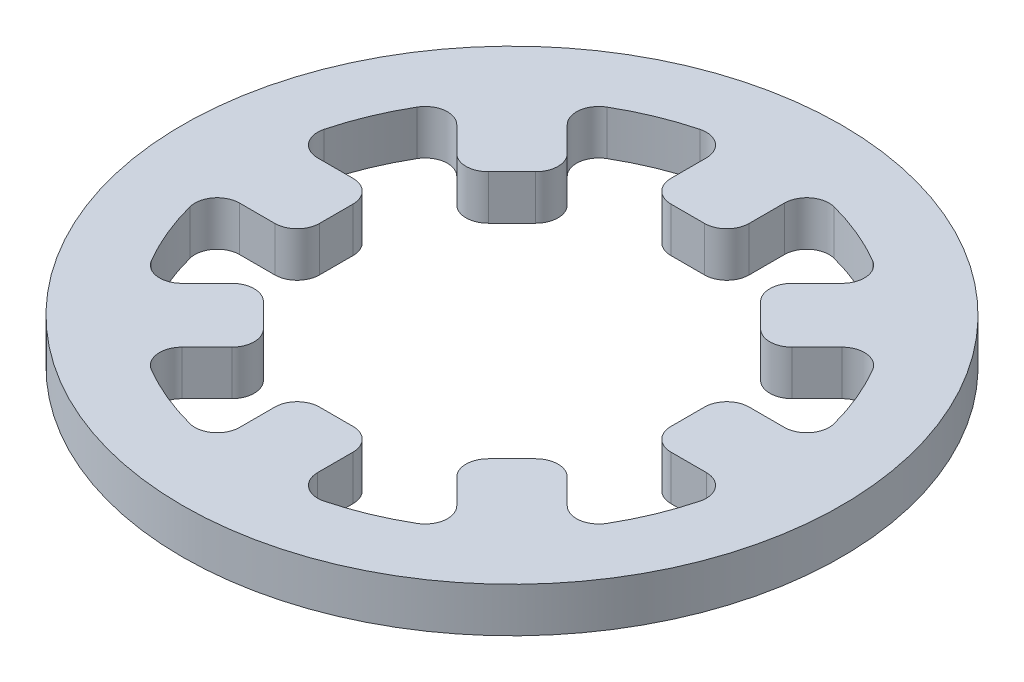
ISO-10303-21;
HEADER;
FILE_DESCRIPTION(('STEP AP214'),'2;1');
FILE_NAME('part.step','',(''),(''),'','','');
FILE_SCHEMA(('AUTOMOTIVE_DESIGN { 1 0 10303 214 1 1 1 1 }'));
ENDSEC;
DATA;
#1=APPLICATION_CONTEXT('core data for automotive mechanical design processes');
#2=APPLICATION_PROTOCOL_DEFINITION('international standard','automotive_design',2000,#1);
#3=PRODUCT_CONTEXT('',#1,'mechanical');
#4=PRODUCT('Part','Part','',(#3));
#5=PRODUCT_RELATED_PRODUCT_CATEGORY('part','',(#4));
#6=PRODUCT_DEFINITION_FORMATION('','',#4);
#7=PRODUCT_DEFINITION_CONTEXT('part definition',#1,'design');
#8=PRODUCT_DEFINITION('design','',#6,#7);
#9=PRODUCT_DEFINITION_SHAPE('','',#8);
#10=(LENGTH_UNIT() NAMED_UNIT(*) SI_UNIT(.MILLI.,.METRE.));
#11=(NAMED_UNIT(*) PLANE_ANGLE_UNIT() SI_UNIT($,.RADIAN.));
#12=(NAMED_UNIT(*) SI_UNIT($,.STERADIAN.) SOLID_ANGLE_UNIT());
#13=UNCERTAINTY_MEASURE_WITH_UNIT(LENGTH_MEASURE(1.E-05),#10,'distance_accuracy_value','');
#14=(GEOMETRIC_REPRESENTATION_CONTEXT(3) GLOBAL_UNCERTAINTY_ASSIGNED_CONTEXT((#13)) GLOBAL_UNIT_ASSIGNED_CONTEXT((#10,
#11,#12)) REPRESENTATION_CONTEXT('',''));
#15=CARTESIAN_POINT('',(0.,0.,0.));
#16=DIRECTION('',(0.,0.,1.));
#17=DIRECTION('',(1.,0.,0.));
#18=AXIS2_PLACEMENT_3D('',#15,#16,#17);
#19=CARTESIAN_POINT('',(0.,1.016,0.));
#20=DIRECTION('',(0.,1.,0.));
#21=DIRECTION('',(0.,0.,1.));
#22=AXIS2_PLACEMENT_3D('',#19,#20,#21);
#23=PLANE('',#22);
#24=CARTESIAN_POINT('',(0.,1.016,0.));
#25=DIRECTION('',(0.,1.,0.));
#26=DIRECTION('',(0.,0.,1.));
#27=AXIS2_PLACEMENT_3D('',#24,#25,#26);
#28=CIRCLE('',#27,7.5);
#29=CARTESIAN_POINT('',(0.,1.016,7.5));
#30=VERTEX_POINT('',#29);
#31=EDGE_CURVE('E11',#30,#30,#28,.T.);
#32=ORIENTED_EDGE('',*,*,#31,.T.);
#33=EDGE_LOOP('',(#32));
#34=FACE_BOUND('',#33,.T.);
#35=DIRECTION('',(0.707106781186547,0.,0.707106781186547));
#36=VECTOR('',#35,1.);
#37=CARTESIAN_POINT('',(-2.55901944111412,1.016,-3.8162552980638));
#38=LINE('',#37,#36);
#39=CARTESIAN_POINT('',(-3.12707475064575,1.016,-4.38431060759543));
#40=VERTEX_POINT('',#39);
#41=CARTESIAN_POINT('',(-2.55901944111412,1.016,-3.8162552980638));
#42=VERTEX_POINT('',#41);
#43=EDGE_CURVE('E442',#40,#42,#38,.T.);
#44=ORIENTED_EDGE('',*,*,#43,.F.);
#45=CARTESIAN_POINT('',(-2.76786450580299,1.016,-4.7435208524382));
#46=DIRECTION('',(0.,1.,0.));
#47=DIRECTION('',(0.,0.,-1.));
#48=AXIS2_PLACEMENT_3D('',#45,#46,#47);
#49=CIRCLE('',#48,0.507999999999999);
#50=CARTESIAN_POINT('',(-3.0238869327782,1.016,-5.18228789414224));
#51=VERTEX_POINT('',#50);
#52=EDGE_CURVE('E434',#51,#40,#49,.T.);
#53=ORIENTED_EDGE('',*,*,#52,.F.);
#54=CARTESIAN_POINT('',(0.,1.016,0.));
#55=DIRECTION('',(0.,1.,0.));
#56=DIRECTION('',(0.,0.,1.));
#57=AXIS2_PLACEMENT_3D('',#54,#55,#56);
#58=CIRCLE('',#57,6.);
#59=CARTESIAN_POINT('',(-1.52621995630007,1.016,-5.80264186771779));
#60=VERTEX_POINT('',#59);
#61=EDGE_CURVE('E578',#60,#51,#58,.T.);
#62=ORIENTED_EDGE('',*,*,#61,.F.);
#63=CARTESIAN_POINT('',(-1.397,1.016,-5.31135152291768));
#64=DIRECTION('',(0.,1.,0.));
#65=DIRECTION('',(0.,0.,1.));
#66=AXIS2_PLACEMENT_3D('',#63,#64,#65);
#67=CIRCLE('',#66,0.508);
#68=CARTESIAN_POINT('',(-0.889,1.016,-5.31135152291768));
#69=VERTEX_POINT('',#68);
#70=EDGE_CURVE('E576',#69,#60,#67,.T.);
#71=ORIENTED_EDGE('',*,*,#70,.F.);
#72=DIRECTION('',(0.,0.,-1.));
#73=VECTOR('',#72,1.);
#74=CARTESIAN_POINT('',(-0.889,1.016,-5.31135152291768));
#75=LINE('',#74,#73);
#76=CARTESIAN_POINT('',(-0.889,1.016,-4.508));
#77=VERTEX_POINT('',#76);
#78=EDGE_CURVE('E574',#77,#69,#75,.T.);
#79=ORIENTED_EDGE('',*,*,#78,.F.);
#80=CARTESIAN_POINT('',(-0.381,1.016,-4.508));
#81=DIRECTION('',(0.,-1.,0.));
#82=DIRECTION('',(0.,0.,1.));
#83=AXIS2_PLACEMENT_3D('',#80,#81,#82);
#84=CIRCLE('',#83,0.508);
#85=CARTESIAN_POINT('',(-0.380999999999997,1.016,-4.));
#86=VERTEX_POINT('',#85);
#87=EDGE_CURVE('E572',#86,#77,#84,.T.);
#88=ORIENTED_EDGE('',*,*,#87,.F.);
#89=DIRECTION('',(-1.,0.,0.));
#90=VECTOR('',#89,1.);
#91=CARTESIAN_POINT('',(-0.380999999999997,1.016,-4.));
#92=LINE('',#91,#90);
#93=CARTESIAN_POINT('',(0.380999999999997,1.016,-4.));
#94=VERTEX_POINT('',#93);
#95=EDGE_CURVE('E570',#94,#86,#92,.T.);
#96=ORIENTED_EDGE('',*,*,#95,.F.);
#97=CARTESIAN_POINT('',(0.381,1.016,-4.508));
#98=DIRECTION('',(0.,-1.,0.));
#99=DIRECTION('',(0.,0.,1.));
#100=AXIS2_PLACEMENT_3D('',#97,#98,#99);
#101=CIRCLE('',#100,0.508);
#102=CARTESIAN_POINT('',(0.889,1.016,-4.508));
#103=VERTEX_POINT('',#102);
#104=EDGE_CURVE('E568',#103,#94,#101,.T.);
#105=ORIENTED_EDGE('',*,*,#104,.F.);
#106=DIRECTION('',(0.,0.,1.));
#107=VECTOR('',#106,1.);
#108=CARTESIAN_POINT('',(0.889,1.016,-4.508));
#109=LINE('',#108,#107);
#110=CARTESIAN_POINT('',(0.889,1.016,-5.31135152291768));
#111=VERTEX_POINT('',#110);
#112=EDGE_CURVE('E566',#111,#103,#109,.T.);
#113=ORIENTED_EDGE('',*,*,#112,.F.);
#114=CARTESIAN_POINT('',(1.397,1.016,-5.31135152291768));
#115=DIRECTION('',(0.,1.,0.));
#116=DIRECTION('',(0.,0.,-1.));
#117=AXIS2_PLACEMENT_3D('',#114,#115,#116);
#118=CIRCLE('',#117,0.508);
#119=CARTESIAN_POINT('',(1.52621995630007,1.016,-5.80264186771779));
#120=VERTEX_POINT('',#119);
#121=EDGE_CURVE('E564',#120,#111,#118,.T.);
#122=ORIENTED_EDGE('',*,*,#121,.F.);
#123=CARTESIAN_POINT('',(0.,1.016,0.));
#124=DIRECTION('',(0.,1.,0.));
#125=DIRECTION('',(0.,0.,1.));
#126=AXIS2_PLACEMENT_3D('',#123,#124,#125);
#127=CIRCLE('',#126,6.);
#128=CARTESIAN_POINT('',(3.02388693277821,1.016,-5.18228789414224));
#129=VERTEX_POINT('',#128);
#130=EDGE_CURVE('E562',#129,#120,#127,.T.);
#131=ORIENTED_EDGE('',*,*,#130,.F.);
#132=CARTESIAN_POINT('',(2.76786450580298,1.016,-4.7435208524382));
#133=DIRECTION('',(0.,1.,0.));
#134=DIRECTION('',(0.,0.,1.));
#135=AXIS2_PLACEMENT_3D('',#132,#133,#134);
#136=CIRCLE('',#135,0.508);
#137=CARTESIAN_POINT('',(3.12707475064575,1.016,-4.38431060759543));
#138=VERTEX_POINT('',#137);
#139=EDGE_CURVE('E560',#138,#129,#136,.T.);
#140=ORIENTED_EDGE('',*,*,#139,.F.);
#141=DIRECTION('',(0.707106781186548,0.,-0.707106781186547));
#142=VECTOR('',#141,1.);
#143=CARTESIAN_POINT('',(3.12707475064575,1.016,-4.38431060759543));
#144=LINE('',#143,#142);
#145=CARTESIAN_POINT('',(2.55901944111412,1.016,-3.8162552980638));
#146=VERTEX_POINT('',#145);
#147=EDGE_CURVE('E558',#146,#138,#144,.T.);
#148=ORIENTED_EDGE('',*,*,#147,.F.);
#149=CARTESIAN_POINT('',(2.91822968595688,1.016,-3.45704505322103));
#150=DIRECTION('',(0.,-1.,0.));
#151=DIRECTION('',(0.,0.,1.));
#152=AXIS2_PLACEMENT_3D('',#149,#150,#151);
#153=CIRCLE('',#152,0.508);
#154=CARTESIAN_POINT('',(2.55901944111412,1.016,-3.09783480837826));
#155=VERTEX_POINT('',#154);
#156=EDGE_CURVE('E556',#155,#146,#153,.T.);
#157=ORIENTED_EDGE('',*,*,#156,.F.);
#158=DIRECTION('',(-0.707106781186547,0.,-0.707106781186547));
#159=VECTOR('',#158,1.);
#160=CARTESIAN_POINT('',(2.55901944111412,1.016,-3.09783480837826));
#161=LINE('',#160,#159);
#162=CARTESIAN_POINT('',(3.09783480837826,1.016,-2.55901944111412));
#163=VERTEX_POINT('',#162);
#164=EDGE_CURVE('E554',#163,#155,#161,.T.);
#165=ORIENTED_EDGE('',*,*,#164,.F.);
#166=CARTESIAN_POINT('',(3.45704505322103,1.016,-2.91822968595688));
#167=DIRECTION('',(0.,-1.,0.));
#168=DIRECTION('',(0.,0.,-1.));
#169=AXIS2_PLACEMENT_3D('',#166,#167,#168);
#170=CIRCLE('',#169,0.508);
#171=CARTESIAN_POINT('',(3.8162552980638,1.016,-2.55901944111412));
#172=VERTEX_POINT('',#171);
#173=EDGE_CURVE('E552',#172,#163,#170,.T.);
#174=ORIENTED_EDGE('',*,*,#173,.F.);
#175=DIRECTION('',(-0.707106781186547,0.,0.707106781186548));
#176=VECTOR('',#175,1.);
#177=CARTESIAN_POINT('',(3.8162552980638,1.016,-2.55901944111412));
#178=LINE('',#177,#176);
#179=CARTESIAN_POINT('',(4.38431060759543,1.016,-3.12707475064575));
#180=VERTEX_POINT('',#179);
#181=EDGE_CURVE('E550',#180,#172,#178,.T.);
#182=ORIENTED_EDGE('',*,*,#181,.F.);
#183=CARTESIAN_POINT('',(4.7435208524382,1.016,-2.76786450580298));
#184=DIRECTION('',(0.,1.,0.));
#185=DIRECTION('',(0.,0.,-1.));
#186=AXIS2_PLACEMENT_3D('',#183,#184,#185);
#187=CIRCLE('',#186,0.508);
#188=CARTESIAN_POINT('',(5.18228789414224,1.016,-3.02388693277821));
#189=VERTEX_POINT('',#188);
#190=EDGE_CURVE('E548',#189,#180,#187,.T.);
#191=ORIENTED_EDGE('',*,*,#190,.F.);
#192=CARTESIAN_POINT('',(0.,1.016,0.));
#193=DIRECTION('',(0.,1.,0.));
#194=DIRECTION('',(0.,0.,1.));
#195=AXIS2_PLACEMENT_3D('',#192,#193,#194);
#196=CIRCLE('',#195,6.);
#197=CARTESIAN_POINT('',(5.80264186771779,1.016,-1.52621995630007));
#198=VERTEX_POINT('',#197);
#199=EDGE_CURVE('E546',#198,#189,#196,.T.);
#200=ORIENTED_EDGE('',*,*,#199,.F.);
#201=CARTESIAN_POINT('',(5.31135152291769,1.016,-1.397));
#202=DIRECTION('',(0.,1.,0.));
#203=DIRECTION('',(0.,0.,1.));
#204=AXIS2_PLACEMENT_3D('',#201,#202,#203);
#205=CIRCLE('',#204,0.507999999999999);
#206=CARTESIAN_POINT('',(5.31135152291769,1.016,-0.889));
#207=VERTEX_POINT('',#206);
#208=EDGE_CURVE('E544',#207,#198,#205,.T.);
#209=ORIENTED_EDGE('',*,*,#208,.F.);
#210=DIRECTION('',(1.,0.,0.));
#211=VECTOR('',#210,1.);
#212=CARTESIAN_POINT('',(5.31135152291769,1.016,-0.889));
#213=LINE('',#212,#211);
#214=CARTESIAN_POINT('',(4.508,1.016,-0.889));
#215=VERTEX_POINT('',#214);
#216=EDGE_CURVE('E542',#215,#207,#213,.T.);
#217=ORIENTED_EDGE('',*,*,#216,.F.);
#218=CARTESIAN_POINT('',(4.508,1.016,-0.381));
#219=DIRECTION('',(0.,-1.,0.));
#220=DIRECTION('',(0.,0.,1.));
#221=AXIS2_PLACEMENT_3D('',#218,#219,#220);
#222=CIRCLE('',#221,0.508);
#223=CARTESIAN_POINT('',(4.,1.016,-0.380999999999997));
#224=VERTEX_POINT('',#223);
#225=EDGE_CURVE('E540',#224,#215,#222,.T.);
#226=ORIENTED_EDGE('',*,*,#225,.F.);
#227=DIRECTION('',(0.,0.,-1.));
#228=VECTOR('',#227,1.);
#229=CARTESIAN_POINT('',(4.,1.016,-0.380999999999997));
#230=LINE('',#229,#228);
#231=CARTESIAN_POINT('',(4.,1.016,0.380999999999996));
#232=VERTEX_POINT('',#231);
#233=EDGE_CURVE('E538',#232,#224,#230,.T.);
#234=ORIENTED_EDGE('',*,*,#233,.F.);
#235=CARTESIAN_POINT('',(4.508,1.016,0.381));
#236=DIRECTION('',(0.,-1.,0.));
#237=DIRECTION('',(0.,0.,-1.));
#238=AXIS2_PLACEMENT_3D('',#235,#236,#237);
#239=CIRCLE('',#238,0.508);
#240=CARTESIAN_POINT('',(4.508,1.016,0.889));
#241=VERTEX_POINT('',#240);
#242=EDGE_CURVE('E536',#241,#232,#239,.T.);
#243=ORIENTED_EDGE('',*,*,#242,.F.);
#244=DIRECTION('',(-1.,0.,0.));
#245=VECTOR('',#244,1.);
#246=CARTESIAN_POINT('',(4.508,1.016,0.889));
#247=LINE('',#246,#245);
#248=CARTESIAN_POINT('',(5.31135152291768,1.016,0.888999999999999));
#249=VERTEX_POINT('',#248);
#250=EDGE_CURVE('E534',#249,#241,#247,.T.);
#251=ORIENTED_EDGE('',*,*,#250,.F.);
#252=CARTESIAN_POINT('',(5.31135152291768,1.016,1.397));
#253=DIRECTION('',(0.,1.,0.));
#254=DIRECTION('',(0.,0.,-1.));
#255=AXIS2_PLACEMENT_3D('',#252,#253,#254);
#256=CIRCLE('',#255,0.508);
#257=CARTESIAN_POINT('',(5.80264186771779,1.016,1.52621995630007));
#258=VERTEX_POINT('',#257);
#259=EDGE_CURVE('E532',#258,#249,#256,.T.);
#260=ORIENTED_EDGE('',*,*,#259,.F.);
#261=CARTESIAN_POINT('',(0.,1.016,0.));
#262=DIRECTION('',(0.,1.,0.));
#263=DIRECTION('',(0.,0.,1.));
#264=AXIS2_PLACEMENT_3D('',#261,#262,#263);
#265=CIRCLE('',#264,6.);
#266=CARTESIAN_POINT('',(5.18228789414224,1.016,3.0238869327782));
#267=VERTEX_POINT('',#266);
#268=EDGE_CURVE('E530',#267,#258,#265,.T.);
#269=ORIENTED_EDGE('',*,*,#268,.F.);
#270=CARTESIAN_POINT('',(4.7435208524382,1.016,2.76786450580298));
#271=DIRECTION('',(0.,1.,0.));
#272=DIRECTION('',(0.,0.,1.));
#273=AXIS2_PLACEMENT_3D('',#270,#271,#272);
#274=CIRCLE('',#273,0.508);
#275=CARTESIAN_POINT('',(4.38431060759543,1.016,3.12707475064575));
#276=VERTEX_POINT('',#275);
#277=EDGE_CURVE('E528',#276,#267,#274,.T.);
#278=ORIENTED_EDGE('',*,*,#277,.F.);
#279=DIRECTION('',(0.707106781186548,0.,0.707106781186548));
#280=VECTOR('',#279,1.);
#281=CARTESIAN_POINT('',(4.38431060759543,1.016,3.12707475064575));
#282=LINE('',#281,#280);
#283=CARTESIAN_POINT('',(3.8162552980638,1.016,2.55901944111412));
#284=VERTEX_POINT('',#283);
#285=EDGE_CURVE('E526',#284,#276,#282,.T.);
#286=ORIENTED_EDGE('',*,*,#285,.F.);
#287=CARTESIAN_POINT('',(3.45704505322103,1.016,2.91822968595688));
#288=DIRECTION('',(0.,-1.,0.));
#289=DIRECTION('',(0.,0.,1.));
#290=AXIS2_PLACEMENT_3D('',#287,#288,#289);
#291=CIRCLE('',#290,0.508);
#292=CARTESIAN_POINT('',(3.09783480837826,1.016,2.55901944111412));
#293=VERTEX_POINT('',#292);
#294=EDGE_CURVE('E524',#293,#284,#291,.T.);
#295=ORIENTED_EDGE('',*,*,#294,.F.);
#296=DIRECTION('',(0.707106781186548,0.,-0.707106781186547));
#297=VECTOR('',#296,1.);
#298=CARTESIAN_POINT('',(3.09783480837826,1.016,2.55901944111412));
#299=LINE('',#298,#297);
#300=CARTESIAN_POINT('',(2.55901944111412,1.016,3.09783480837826));
#301=VERTEX_POINT('',#300);
#302=EDGE_CURVE('E522',#301,#293,#299,.T.);
#303=ORIENTED_EDGE('',*,*,#302,.F.);
#304=CARTESIAN_POINT('',(2.91822968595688,1.016,3.45704505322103));
#305=DIRECTION('',(0.,-1.,0.));
#306=DIRECTION('',(0.,0.,-1.));
#307=AXIS2_PLACEMENT_3D('',#304,#305,#306);
#308=CIRCLE('',#307,0.508);
#309=CARTESIAN_POINT('',(2.55901944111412,1.016,3.8162552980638));
#310=VERTEX_POINT('',#309);
#311=EDGE_CURVE('E520',#310,#301,#308,.T.);
#312=ORIENTED_EDGE('',*,*,#311,.F.);
#313=DIRECTION('',(-0.707106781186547,0.,-0.707106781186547));
#314=VECTOR('',#313,1.);
#315=CARTESIAN_POINT('',(2.55901944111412,1.016,3.8162552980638));
#316=LINE('',#315,#314);
#317=CARTESIAN_POINT('',(3.12707475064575,1.016,4.38431060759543));
#318=VERTEX_POINT('',#317);
#319=EDGE_CURVE('E518',#318,#310,#316,.T.);
#320=ORIENTED_EDGE('',*,*,#319,.F.);
#321=CARTESIAN_POINT('',(2.76786450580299,1.016,4.7435208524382));
#322=DIRECTION('',(0.,1.,0.));
#323=DIRECTION('',(0.,0.,-1.));
#324=AXIS2_PLACEMENT_3D('',#321,#322,#323);
#325=CIRCLE('',#324,0.507999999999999);
#326=CARTESIAN_POINT('',(3.02388693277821,1.016,5.18228789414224));
#327=VERTEX_POINT('',#326);
#328=EDGE_CURVE('E516',#327,#318,#325,.T.);
#329=ORIENTED_EDGE('',*,*,#328,.F.);
#330=CARTESIAN_POINT('',(0.,1.016,0.));
#331=DIRECTION('',(0.,1.,0.));
#332=DIRECTION('',(0.,0.,1.));
#333=AXIS2_PLACEMENT_3D('',#330,#331,#332);
#334=CIRCLE('',#333,6.);
#335=CARTESIAN_POINT('',(1.52621995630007,1.016,5.80264186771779));
#336=VERTEX_POINT('',#335);
#337=EDGE_CURVE('E514',#336,#327,#334,.T.);
#338=ORIENTED_EDGE('',*,*,#337,.F.);
#339=CARTESIAN_POINT('',(1.397,1.016,5.31135152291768));
#340=DIRECTION('',(0.,1.,0.));
#341=DIRECTION('',(0.,0.,1.));
#342=AXIS2_PLACEMENT_3D('',#339,#340,#341);
#343=CIRCLE('',#342,0.508);
#344=CARTESIAN_POINT('',(0.889000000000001,1.016,5.31135152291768));
#345=VERTEX_POINT('',#344);
#346=EDGE_CURVE('E512',#345,#336,#343,.T.);
#347=ORIENTED_EDGE('',*,*,#346,.F.);
#348=DIRECTION('',(0.,0.,1.));
#349=VECTOR('',#348,1.);
#350=CARTESIAN_POINT('',(0.889000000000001,1.016,5.31135152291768));
#351=LINE('',#350,#349);
#352=CARTESIAN_POINT('',(0.889000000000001,1.016,4.508));
#353=VERTEX_POINT('',#352);
#354=EDGE_CURVE('E510',#353,#345,#351,.T.);
#355=ORIENTED_EDGE('',*,*,#354,.F.);
#356=CARTESIAN_POINT('',(0.381000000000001,1.016,4.508));
#357=DIRECTION('',(0.,-1.,0.));
#358=DIRECTION('',(0.,0.,1.));
#359=AXIS2_PLACEMENT_3D('',#356,#357,#358);
#360=CIRCLE('',#359,0.508);
#361=CARTESIAN_POINT('',(0.380999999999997,1.016,4.));
#362=VERTEX_POINT('',#361);
#363=EDGE_CURVE('E508',#362,#353,#360,.T.);
#364=ORIENTED_EDGE('',*,*,#363,.F.);
#365=DIRECTION('',(1.,0.,0.));
#366=VECTOR('',#365,1.);
#367=CARTESIAN_POINT('',(0.380999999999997,1.016,4.));
#368=LINE('',#367,#366);
#369=CARTESIAN_POINT('',(-0.381,1.016,4.));
#370=VERTEX_POINT('',#369);
#371=EDGE_CURVE('E506',#370,#362,#368,.T.);
#372=ORIENTED_EDGE('',*,*,#371,.F.);
#373=CARTESIAN_POINT('',(-0.381,1.016,4.508));
#374=DIRECTION('',(0.,-1.,0.));
#375=DIRECTION('',(0.,0.,-1.));
#376=AXIS2_PLACEMENT_3D('',#373,#374,#375);
#377=CIRCLE('',#376,0.508);
#378=CARTESIAN_POINT('',(-0.888999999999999,1.016,4.508));
#379=VERTEX_POINT('',#378);
#380=EDGE_CURVE('E504',#379,#370,#377,.T.);
#381=ORIENTED_EDGE('',*,*,#380,.F.);
#382=DIRECTION('',(0.,0.,-1.));
#383=VECTOR('',#382,1.);
#384=CARTESIAN_POINT('',(-0.888999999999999,1.016,4.508));
#385=LINE('',#384,#383);
#386=CARTESIAN_POINT('',(-0.888999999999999,1.016,5.31135152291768));
#387=VERTEX_POINT('',#386);
#388=EDGE_CURVE('E502',#387,#379,#385,.T.);
#389=ORIENTED_EDGE('',*,*,#388,.F.);
#390=CARTESIAN_POINT('',(-1.397,1.016,5.31135152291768));
#391=DIRECTION('',(0.,1.,0.));
#392=DIRECTION('',(0.,0.,-1.));
#393=AXIS2_PLACEMENT_3D('',#390,#391,#392);
#394=CIRCLE('',#393,0.508);
#395=CARTESIAN_POINT('',(-1.52621995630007,1.016,5.80264186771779));
#396=VERTEX_POINT('',#395);
#397=EDGE_CURVE('E500',#396,#387,#394,.T.);
#398=ORIENTED_EDGE('',*,*,#397,.F.);
#399=CARTESIAN_POINT('',(0.,1.016,0.));
#400=DIRECTION('',(0.,1.,0.));
#401=DIRECTION('',(0.,0.,1.));
#402=AXIS2_PLACEMENT_3D('',#399,#400,#401);
#403=CIRCLE('',#402,6.);
#404=CARTESIAN_POINT('',(-3.0238869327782,1.016,5.18228789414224));
#405=VERTEX_POINT('',#404);
#406=EDGE_CURVE('E498',#405,#396,#403,.T.);
#407=ORIENTED_EDGE('',*,*,#406,.F.);
#408=CARTESIAN_POINT('',(-2.76786450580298,1.016,4.7435208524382));
#409=DIRECTION('',(0.,1.,0.));
#410=DIRECTION('',(0.,0.,1.));
#411=AXIS2_PLACEMENT_3D('',#408,#409,#410);
#412=CIRCLE('',#411,0.508);
#413=CARTESIAN_POINT('',(-3.12707475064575,1.016,4.38431060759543));
#414=VERTEX_POINT('',#413);
#415=EDGE_CURVE('E496',#414,#405,#412,.T.);
#416=ORIENTED_EDGE('',*,*,#415,.F.);
#417=DIRECTION('',(-0.707106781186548,0.,0.707106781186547));
#418=VECTOR('',#417,1.);
#419=CARTESIAN_POINT('',(-3.12707475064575,1.016,4.38431060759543));
#420=LINE('',#419,#418);
#421=CARTESIAN_POINT('',(-2.55901944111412,1.016,3.8162552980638));
#422=VERTEX_POINT('',#421);
#423=EDGE_CURVE('E494',#422,#414,#420,.T.);
#424=ORIENTED_EDGE('',*,*,#423,.F.);
#425=CARTESIAN_POINT('',(-2.91822968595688,1.016,3.45704505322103));
#426=DIRECTION('',(0.,-1.,0.));
#427=DIRECTION('',(0.,0.,1.));
#428=AXIS2_PLACEMENT_3D('',#425,#426,#427);
#429=CIRCLE('',#428,0.508);
#430=CARTESIAN_POINT('',(-2.55901944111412,1.016,3.09783480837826));
#431=VERTEX_POINT('',#430);
#432=EDGE_CURVE('E492',#431,#422,#429,.T.);
#433=ORIENTED_EDGE('',*,*,#432,.F.);
#434=DIRECTION('',(0.707106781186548,0.,0.707106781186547));
#435=VECTOR('',#434,1.);
#436=CARTESIAN_POINT('',(-2.55901944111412,1.016,3.09783480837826));
#437=LINE('',#436,#435);
#438=CARTESIAN_POINT('',(-3.09783480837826,1.016,2.55901944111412));
#439=VERTEX_POINT('',#438);
#440=EDGE_CURVE('E490',#439,#431,#437,.T.);
#441=ORIENTED_EDGE('',*,*,#440,.F.);
#442=CARTESIAN_POINT('',(-3.45704505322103,1.016,2.91822968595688));
#443=DIRECTION('',(0.,-1.,0.));
#444=DIRECTION('',(0.,0.,-1.));
#445=AXIS2_PLACEMENT_3D('',#442,#443,#444);
#446=CIRCLE('',#445,0.508);
#447=CARTESIAN_POINT('',(-3.8162552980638,1.016,2.55901944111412));
#448=VERTEX_POINT('',#447);
#449=EDGE_CURVE('E488',#448,#439,#446,.T.);
#450=ORIENTED_EDGE('',*,*,#449,.F.);
#451=DIRECTION('',(0.707106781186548,0.,-0.707106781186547));
#452=VECTOR('',#451,1.);
#453=CARTESIAN_POINT('',(-3.8162552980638,1.016,2.55901944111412));
#454=LINE('',#453,#452);
#455=CARTESIAN_POINT('',(-4.38431060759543,1.016,3.12707475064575));
#456=VERTEX_POINT('',#455);
#457=EDGE_CURVE('E486',#456,#448,#454,.T.);
#458=ORIENTED_EDGE('',*,*,#457,.F.);
#459=CARTESIAN_POINT('',(-4.7435208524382,1.016,2.76786450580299));
#460=DIRECTION('',(0.,1.,0.));
#461=DIRECTION('',(0.,0.,-1.));
#462=AXIS2_PLACEMENT_3D('',#459,#460,#461);
#463=CIRCLE('',#462,0.508);
#464=CARTESIAN_POINT('',(-5.18228789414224,1.016,3.0238869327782));
#465=VERTEX_POINT('',#464);
#466=EDGE_CURVE('E484',#465,#456,#463,.T.);
#467=ORIENTED_EDGE('',*,*,#466,.F.);
#468=CARTESIAN_POINT('',(0.,1.016,0.));
#469=DIRECTION('',(0.,1.,0.));
#470=DIRECTION('',(0.,0.,1.));
#471=AXIS2_PLACEMENT_3D('',#468,#469,#470);
#472=CIRCLE('',#471,6.);
#473=CARTESIAN_POINT('',(-5.80264186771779,1.016,1.52621995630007));
#474=VERTEX_POINT('',#473);
#475=EDGE_CURVE('E482',#474,#465,#472,.T.);
#476=ORIENTED_EDGE('',*,*,#475,.F.);
#477=CARTESIAN_POINT('',(-5.31135152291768,1.016,1.397));
#478=DIRECTION('',(0.,1.,0.));
#479=DIRECTION('',(0.,0.,1.));
#480=AXIS2_PLACEMENT_3D('',#477,#478,#479);
#481=CIRCLE('',#480,0.508);
#482=CARTESIAN_POINT('',(-5.31135152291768,1.016,0.889000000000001));
#483=VERTEX_POINT('',#482);
#484=EDGE_CURVE('E480',#483,#474,#481,.T.);
#485=ORIENTED_EDGE('',*,*,#484,.F.);
#486=DIRECTION('',(-1.,0.,0.));
#487=VECTOR('',#486,1.);
#488=CARTESIAN_POINT('',(-5.31135152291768,1.016,0.889000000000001));
#489=LINE('',#488,#487);
#490=CARTESIAN_POINT('',(-4.508,1.016,0.889000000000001));
#491=VERTEX_POINT('',#490);
#492=EDGE_CURVE('E478',#491,#483,#489,.T.);
#493=ORIENTED_EDGE('',*,*,#492,.F.);
#494=CARTESIAN_POINT('',(-4.508,1.016,0.381000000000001));
#495=DIRECTION('',(0.,-1.,0.));
#496=DIRECTION('',(0.,0.,1.));
#497=AXIS2_PLACEMENT_3D('',#494,#495,#496);
#498=CIRCLE('',#497,0.508);
#499=CARTESIAN_POINT('',(-4.,1.016,0.380999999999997));
#500=VERTEX_POINT('',#499);
#501=EDGE_CURVE('E476',#500,#491,#498,.T.);
#502=ORIENTED_EDGE('',*,*,#501,.F.);
#503=DIRECTION('',(0.,0.,1.));
#504=VECTOR('',#503,1.);
#505=CARTESIAN_POINT('',(-4.,1.016,0.380999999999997));
#506=LINE('',#505,#504);
#507=CARTESIAN_POINT('',(-4.,1.016,-0.380999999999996));
#508=VERTEX_POINT('',#507);
#509=EDGE_CURVE('E474',#508,#500,#506,.T.);
#510=ORIENTED_EDGE('',*,*,#509,.F.);
#511=CARTESIAN_POINT('',(-4.508,1.016,-0.380999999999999));
#512=DIRECTION('',(0.,-1.,0.));
#513=DIRECTION('',(0.,0.,-1.));
#514=AXIS2_PLACEMENT_3D('',#511,#512,#513);
#515=CIRCLE('',#514,0.508);
#516=CARTESIAN_POINT('',(-4.508,1.016,-0.888999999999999));
#517=VERTEX_POINT('',#516);
#518=EDGE_CURVE('E472',#517,#508,#515,.T.);
#519=ORIENTED_EDGE('',*,*,#518,.F.);
#520=DIRECTION('',(1.,0.,0.));
#521=VECTOR('',#520,1.);
#522=CARTESIAN_POINT('',(-4.508,1.016,-0.888999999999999));
#523=LINE('',#522,#521);
#524=CARTESIAN_POINT('',(-5.31135152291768,1.016,-0.888999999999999));
#525=VERTEX_POINT('',#524);
#526=EDGE_CURVE('E470',#525,#517,#523,.T.);
#527=ORIENTED_EDGE('',*,*,#526,.F.);
#528=CARTESIAN_POINT('',(-5.31135152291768,1.016,-1.397));
#529=DIRECTION('',(0.,1.,0.));
#530=DIRECTION('',(0.,0.,-1.));
#531=AXIS2_PLACEMENT_3D('',#528,#529,#530);
#532=CIRCLE('',#531,0.508);
#533=CARTESIAN_POINT('',(-5.80264186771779,1.016,-1.52621995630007));
#534=VERTEX_POINT('',#533);
#535=EDGE_CURVE('E468',#534,#525,#532,.T.);
#536=ORIENTED_EDGE('',*,*,#535,.F.);
#537=CARTESIAN_POINT('',(0.,1.016,0.));
#538=DIRECTION('',(0.,1.,0.));
#539=DIRECTION('',(0.,0.,1.));
#540=AXIS2_PLACEMENT_3D('',#537,#538,#539);
#541=CIRCLE('',#540,6.);
#542=CARTESIAN_POINT('',(-5.18228789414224,1.016,-3.0238869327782));
#543=VERTEX_POINT('',#542);
#544=EDGE_CURVE('E466',#543,#534,#541,.T.);
#545=ORIENTED_EDGE('',*,*,#544,.F.);
#546=CARTESIAN_POINT('',(-4.7435208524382,1.016,-2.76786450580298));
#547=DIRECTION('',(0.,1.,0.));
#548=DIRECTION('',(0.,0.,1.));
#549=AXIS2_PLACEMENT_3D('',#546,#547,#548);
#550=CIRCLE('',#549,0.508);
#551=CARTESIAN_POINT('',(-4.38431060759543,1.016,-3.12707475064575));
#552=VERTEX_POINT('',#551);
#553=EDGE_CURVE('E464',#552,#543,#550,.T.);
#554=ORIENTED_EDGE('',*,*,#553,.F.);
#555=DIRECTION('',(-0.707106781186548,0.,-0.707106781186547));
#556=VECTOR('',#555,1.);
#557=CARTESIAN_POINT('',(-4.38431060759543,1.016,-3.12707475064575));
#558=LINE('',#557,#556);
#559=CARTESIAN_POINT('',(-3.8162552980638,1.016,-2.55901944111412));
#560=VERTEX_POINT('',#559);
#561=EDGE_CURVE('E462',#560,#552,#558,.T.);
#562=ORIENTED_EDGE('',*,*,#561,.F.);
#563=CARTESIAN_POINT('',(-3.45704505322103,1.016,-2.91822968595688));
#564=DIRECTION('',(0.,-1.,0.));
#565=DIRECTION('',(0.,0.,1.));
#566=AXIS2_PLACEMENT_3D('',#563,#564,#565);
#567=CIRCLE('',#566,0.508);
#568=CARTESIAN_POINT('',(-3.09783480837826,1.016,-2.55901944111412));
#569=VERTEX_POINT('',#568);
#570=EDGE_CURVE('E460',#569,#560,#567,.T.);
#571=ORIENTED_EDGE('',*,*,#570,.F.);
#572=DIRECTION('',(-0.707106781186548,0.,0.707106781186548));
#573=VECTOR('',#572,1.);
#574=CARTESIAN_POINT('',(-3.09783480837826,1.016,-2.55901944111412));
#575=LINE('',#574,#573);
#576=CARTESIAN_POINT('',(-2.55901944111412,1.016,-3.09783480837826));
#577=VERTEX_POINT('',#576);
#578=EDGE_CURVE('E456',#577,#569,#575,.T.);
#579=ORIENTED_EDGE('',*,*,#578,.F.);
#580=CARTESIAN_POINT('',(-2.91822968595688,1.016,-3.45704505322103));
#581=DIRECTION('',(0.,-1.,0.));
#582=DIRECTION('',(0.,0.,-1.));
#583=AXIS2_PLACEMENT_3D('',#580,#581,#582);
#584=CIRCLE('',#583,0.508);
#585=EDGE_CURVE('E454',#42,#577,#584,.T.);
#586=ORIENTED_EDGE('',*,*,#585,.F.);
#587=EDGE_LOOP('',(#44,#53,#62,#71,#79,#88,#96,#105,#113,#122,#131,#140,#148,#157,#165,#174,
#182,#191,#200,#209,#217,#226,#234,#243,#251,#260,#269,#278,#286,#295,#303,#312,#320,#329,#338,
#347,#355,#364,#372,#381,#389,#398,#407,#416,#424,#433,#441,#450,#458,#467,#476,#485,#493,#502,
#510,#519,#527,#536,#545,#554,#562,#571,#579,#586));
#588=FACE_BOUND('',#587,.T.);
#589=ADVANCED_FACE('F33',(#34,#588),#23,.T.);
#590=CARTESIAN_POINT('',(0.,0.,0.));
#591=DIRECTION('',(0.,1.,0.));
#592=DIRECTION('',(0.,0.,1.));
#593=AXIS2_PLACEMENT_3D('',#590,#591,#592);
#594=PLANE('',#593);
#595=CARTESIAN_POINT('',(0.,0.,0.));
#596=DIRECTION('',(0.,1.,0.));
#597=DIRECTION('',(0.,0.,1.));
#598=AXIS2_PLACEMENT_3D('',#595,#596,#597);
#599=CIRCLE('',#598,7.5);
#600=CARTESIAN_POINT('',(0.,0.,7.5));
#601=VERTEX_POINT('',#600);
#602=EDGE_CURVE('E37',#601,#601,#599,.T.);
#603=ORIENTED_EDGE('',*,*,#602,.F.);
#604=EDGE_LOOP('',(#603));
#605=FACE_BOUND('',#604,.T.);
#606=CARTESIAN_POINT('',(-2.76786450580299,0.,-4.7435208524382));
#607=DIRECTION('',(0.,1.,0.));
#608=DIRECTION('',(0.,0.,-1.));
#609=AXIS2_PLACEMENT_3D('',#606,#607,#608);
#610=CIRCLE('',#609,0.507999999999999);
#611=CARTESIAN_POINT('',(-3.0238869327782,0.,-5.18228789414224));
#612=VERTEX_POINT('',#611);
#613=CARTESIAN_POINT('',(-3.12707475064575,0.,-4.38431060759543));
#614=VERTEX_POINT('',#613);
#615=EDGE_CURVE('E56',#612,#614,#610,.T.);
#616=ORIENTED_EDGE('',*,*,#615,.T.);
#617=DIRECTION('',(0.707106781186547,0.,0.707106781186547));
#618=VECTOR('',#617,1.);
#619=CARTESIAN_POINT('',(-2.55901944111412,0.,-3.8162552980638));
#620=LINE('',#619,#618);
#621=CARTESIAN_POINT('',(-2.55901944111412,0.,-3.8162552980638));
#622=VERTEX_POINT('',#621);
#623=EDGE_CURVE('E449',#614,#622,#620,.T.);
#624=ORIENTED_EDGE('',*,*,#623,.T.);
#625=CARTESIAN_POINT('',(-2.91822968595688,0.,-3.45704505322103));
#626=DIRECTION('',(0.,-1.,0.));
#627=DIRECTION('',(0.,0.,-1.));
#628=AXIS2_PLACEMENT_3D('',#625,#626,#627);
#629=CIRCLE('',#628,0.508);
#630=CARTESIAN_POINT('',(-2.55901944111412,0.,-3.09783480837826));
#631=VERTEX_POINT('',#630);
#632=EDGE_CURVE('E582',#622,#631,#629,.T.);
#633=ORIENTED_EDGE('',*,*,#632,.T.);
#634=DIRECTION('',(-0.707106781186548,0.,0.707106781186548));
#635=VECTOR('',#634,1.);
#636=CARTESIAN_POINT('',(-3.09783480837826,0.,-2.55901944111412));
#637=LINE('',#636,#635);
#638=CARTESIAN_POINT('',(-3.09783480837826,0.,-2.55901944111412));
#639=VERTEX_POINT('',#638);
#640=EDGE_CURVE('E585',#631,#639,#637,.T.);
#641=ORIENTED_EDGE('',*,*,#640,.T.);
#642=CARTESIAN_POINT('',(-3.45704505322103,0.,-2.91822968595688));
#643=DIRECTION('',(0.,-1.,0.));
#644=DIRECTION('',(0.,0.,1.));
#645=AXIS2_PLACEMENT_3D('',#642,#643,#644);
#646=CIRCLE('',#645,0.508);
#647=CARTESIAN_POINT('',(-3.8162552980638,0.,-2.55901944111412));
#648=VERTEX_POINT('',#647);
#649=EDGE_CURVE('E588',#639,#648,#646,.T.);
#650=ORIENTED_EDGE('',*,*,#649,.T.);
#651=DIRECTION('',(-0.707106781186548,0.,-0.707106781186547));
#652=VECTOR('',#651,1.);
#653=CARTESIAN_POINT('',(-4.38431060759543,0.,-3.12707475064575));
#654=LINE('',#653,#652);
#655=CARTESIAN_POINT('',(-4.38431060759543,0.,-3.12707475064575));
#656=VERTEX_POINT('',#655);
#657=EDGE_CURVE('E591',#648,#656,#654,.T.);
#658=ORIENTED_EDGE('',*,*,#657,.T.);
#659=CARTESIAN_POINT('',(-4.7435208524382,0.,-2.76786450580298));
#660=DIRECTION('',(0.,1.,0.));
#661=DIRECTION('',(0.,0.,1.));
#662=AXIS2_PLACEMENT_3D('',#659,#660,#661);
#663=CIRCLE('',#662,0.508);
#664=CARTESIAN_POINT('',(-5.18228789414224,0.,-3.0238869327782));
#665=VERTEX_POINT('',#664);
#666=EDGE_CURVE('E594',#656,#665,#663,.T.);
#667=ORIENTED_EDGE('',*,*,#666,.T.);
#668=CARTESIAN_POINT('',(0.,0.,0.));
#669=DIRECTION('',(0.,1.,0.));
#670=DIRECTION('',(0.,0.,1.));
#671=AXIS2_PLACEMENT_3D('',#668,#669,#670);
#672=CIRCLE('',#671,6.);
#673=CARTESIAN_POINT('',(-5.80264186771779,0.,-1.52621995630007));
#674=VERTEX_POINT('',#673);
#675=EDGE_CURVE('E597',#665,#674,#672,.T.);
#676=ORIENTED_EDGE('',*,*,#675,.T.);
#677=CARTESIAN_POINT('',(-5.31135152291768,0.,-1.397));
#678=DIRECTION('',(0.,1.,0.));
#679=DIRECTION('',(0.,0.,-1.));
#680=AXIS2_PLACEMENT_3D('',#677,#678,#679);
#681=CIRCLE('',#680,0.508);
#682=CARTESIAN_POINT('',(-5.31135152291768,0.,-0.888999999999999));
#683=VERTEX_POINT('',#682);
#684=EDGE_CURVE('E600',#674,#683,#681,.T.);
#685=ORIENTED_EDGE('',*,*,#684,.T.);
#686=DIRECTION('',(1.,0.,0.));
#687=VECTOR('',#686,1.);
#688=CARTESIAN_POINT('',(-4.508,0.,-0.888999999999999));
#689=LINE('',#688,#687);
#690=CARTESIAN_POINT('',(-4.508,0.,-0.888999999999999));
#691=VERTEX_POINT('',#690);
#692=EDGE_CURVE('E603',#683,#691,#689,.T.);
#693=ORIENTED_EDGE('',*,*,#692,.T.);
#694=CARTESIAN_POINT('',(-4.508,0.,-0.380999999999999));
#695=DIRECTION('',(0.,-1.,0.));
#696=DIRECTION('',(0.,0.,-1.));
#697=AXIS2_PLACEMENT_3D('',#694,#695,#696);
#698=CIRCLE('',#697,0.508);
#699=CARTESIAN_POINT('',(-4.,0.,-0.380999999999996));
#700=VERTEX_POINT('',#699);
#701=EDGE_CURVE('E606',#691,#700,#698,.T.);
#702=ORIENTED_EDGE('',*,*,#701,.T.);
#703=DIRECTION('',(0.,0.,1.));
#704=VECTOR('',#703,1.);
#705=CARTESIAN_POINT('',(-4.,0.,0.380999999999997));
#706=LINE('',#705,#704);
#707=CARTESIAN_POINT('',(-4.,0.,0.380999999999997));
#708=VERTEX_POINT('',#707);
#709=EDGE_CURVE('E609',#700,#708,#706,.T.);
#710=ORIENTED_EDGE('',*,*,#709,.T.);
#711=CARTESIAN_POINT('',(-4.508,0.,0.381000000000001));
#712=DIRECTION('',(0.,-1.,0.));
#713=DIRECTION('',(0.,0.,1.));
#714=AXIS2_PLACEMENT_3D('',#711,#712,#713);
#715=CIRCLE('',#714,0.508);
#716=CARTESIAN_POINT('',(-4.508,0.,0.889000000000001));
#717=VERTEX_POINT('',#716);
#718=EDGE_CURVE('E612',#708,#717,#715,.T.);
#719=ORIENTED_EDGE('',*,*,#718,.T.);
#720=DIRECTION('',(-1.,0.,0.));
#721=VECTOR('',#720,1.);
#722=CARTESIAN_POINT('',(-5.31135152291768,0.,0.889000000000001));
#723=LINE('',#722,#721);
#724=CARTESIAN_POINT('',(-5.31135152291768,0.,0.889000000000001));
#725=VERTEX_POINT('',#724);
#726=EDGE_CURVE('E615',#717,#725,#723,.T.);
#727=ORIENTED_EDGE('',*,*,#726,.T.);
#728=CARTESIAN_POINT('',(-5.31135152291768,0.,1.397));
#729=DIRECTION('',(0.,1.,0.));
#730=DIRECTION('',(0.,0.,1.));
#731=AXIS2_PLACEMENT_3D('',#728,#729,#730);
#732=CIRCLE('',#731,0.508);
#733=CARTESIAN_POINT('',(-5.80264186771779,0.,1.52621995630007));
#734=VERTEX_POINT('',#733);
#735=EDGE_CURVE('E618',#725,#734,#732,.T.);
#736=ORIENTED_EDGE('',*,*,#735,.T.);
#737=CARTESIAN_POINT('',(0.,0.,0.));
#738=DIRECTION('',(0.,1.,0.));
#739=DIRECTION('',(0.,0.,1.));
#740=AXIS2_PLACEMENT_3D('',#737,#738,#739);
#741=CIRCLE('',#740,6.);
#742=CARTESIAN_POINT('',(-5.18228789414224,0.,3.0238869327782));
#743=VERTEX_POINT('',#742);
#744=EDGE_CURVE('E621',#734,#743,#741,.T.);
#745=ORIENTED_EDGE('',*,*,#744,.T.);
#746=CARTESIAN_POINT('',(-4.7435208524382,0.,2.76786450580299));
#747=DIRECTION('',(0.,1.,0.));
#748=DIRECTION('',(0.,0.,-1.));
#749=AXIS2_PLACEMENT_3D('',#746,#747,#748);
#750=CIRCLE('',#749,0.508);
#751=CARTESIAN_POINT('',(-4.38431060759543,0.,3.12707475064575));
#752=VERTEX_POINT('',#751);
#753=EDGE_CURVE('E624',#743,#752,#750,.T.);
#754=ORIENTED_EDGE('',*,*,#753,.T.);
#755=DIRECTION('',(0.707106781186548,0.,-0.707106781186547));
#756=VECTOR('',#755,1.);
#757=CARTESIAN_POINT('',(-3.8162552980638,0.,2.55901944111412));
#758=LINE('',#757,#756);
#759=CARTESIAN_POINT('',(-3.8162552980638,0.,2.55901944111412));
#760=VERTEX_POINT('',#759);
#761=EDGE_CURVE('E627',#752,#760,#758,.T.);
#762=ORIENTED_EDGE('',*,*,#761,.T.);
#763=CARTESIAN_POINT('',(-3.45704505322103,0.,2.91822968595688));
#764=DIRECTION('',(0.,-1.,0.));
#765=DIRECTION('',(0.,0.,-1.));
#766=AXIS2_PLACEMENT_3D('',#763,#764,#765);
#767=CIRCLE('',#766,0.508);
#768=CARTESIAN_POINT('',(-3.09783480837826,0.,2.55901944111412));
#769=VERTEX_POINT('',#768);
#770=EDGE_CURVE('E630',#760,#769,#767,.T.);
#771=ORIENTED_EDGE('',*,*,#770,.T.);
#772=DIRECTION('',(0.707106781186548,0.,0.707106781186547));
#773=VECTOR('',#772,1.);
#774=CARTESIAN_POINT('',(-2.55901944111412,0.,3.09783480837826));
#775=LINE('',#774,#773);
#776=CARTESIAN_POINT('',(-2.55901944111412,0.,3.09783480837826));
#777=VERTEX_POINT('',#776);
#778=EDGE_CURVE('E633',#769,#777,#775,.T.);
#779=ORIENTED_EDGE('',*,*,#778,.T.);
#780=CARTESIAN_POINT('',(-2.91822968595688,0.,3.45704505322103));
#781=DIRECTION('',(0.,-1.,0.));
#782=DIRECTION('',(0.,0.,1.));
#783=AXIS2_PLACEMENT_3D('',#780,#781,#782);
#784=CIRCLE('',#783,0.508);
#785=CARTESIAN_POINT('',(-2.55901944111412,0.,3.8162552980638));
#786=VERTEX_POINT('',#785);
#787=EDGE_CURVE('E636',#777,#786,#784,.T.);
#788=ORIENTED_EDGE('',*,*,#787,.T.);
#789=DIRECTION('',(-0.707106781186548,0.,0.707106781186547));
#790=VECTOR('',#789,1.);
#791=CARTESIAN_POINT('',(-3.12707475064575,0.,4.38431060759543));
#792=LINE('',#791,#790);
#793=CARTESIAN_POINT('',(-3.12707475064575,0.,4.38431060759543));
#794=VERTEX_POINT('',#793);
#795=EDGE_CURVE('E639',#786,#794,#792,.T.);
#796=ORIENTED_EDGE('',*,*,#795,.T.);
#797=CARTESIAN_POINT('',(-2.76786450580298,0.,4.7435208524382));
#798=DIRECTION('',(0.,1.,0.));
#799=DIRECTION('',(0.,0.,1.));
#800=AXIS2_PLACEMENT_3D('',#797,#798,#799);
#801=CIRCLE('',#800,0.508);
#802=CARTESIAN_POINT('',(-3.0238869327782,0.,5.18228789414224));
#803=VERTEX_POINT('',#802);
#804=EDGE_CURVE('E642',#794,#803,#801,.T.);
#805=ORIENTED_EDGE('',*,*,#804,.T.);
#806=CARTESIAN_POINT('',(0.,0.,0.));
#807=DIRECTION('',(0.,1.,0.));
#808=DIRECTION('',(0.,0.,1.));
#809=AXIS2_PLACEMENT_3D('',#806,#807,#808);
#810=CIRCLE('',#809,6.);
#811=CARTESIAN_POINT('',(-1.52621995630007,0.,5.80264186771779));
#812=VERTEX_POINT('',#811);
#813=EDGE_CURVE('E645',#803,#812,#810,.T.);
#814=ORIENTED_EDGE('',*,*,#813,.T.);
#815=CARTESIAN_POINT('',(-1.397,0.,5.31135152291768));
#816=DIRECTION('',(0.,1.,0.));
#817=DIRECTION('',(0.,0.,-1.));
#818=AXIS2_PLACEMENT_3D('',#815,#816,#817);
#819=CIRCLE('',#818,0.508);
#820=CARTESIAN_POINT('',(-0.888999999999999,0.,5.31135152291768));
#821=VERTEX_POINT('',#820);
#822=EDGE_CURVE('E648',#812,#821,#819,.T.);
#823=ORIENTED_EDGE('',*,*,#822,.T.);
#824=DIRECTION('',(0.,0.,-1.));
#825=VECTOR('',#824,1.);
#826=CARTESIAN_POINT('',(-0.888999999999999,0.,4.508));
#827=LINE('',#826,#825);
#828=CARTESIAN_POINT('',(-0.888999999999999,0.,4.508));
#829=VERTEX_POINT('',#828);
#830=EDGE_CURVE('E651',#821,#829,#827,.T.);
#831=ORIENTED_EDGE('',*,*,#830,.T.);
#832=CARTESIAN_POINT('',(-0.381,0.,4.508));
#833=DIRECTION('',(0.,-1.,0.));
#834=DIRECTION('',(0.,0.,-1.));
#835=AXIS2_PLACEMENT_3D('',#832,#833,#834);
#836=CIRCLE('',#835,0.508);
#837=CARTESIAN_POINT('',(-0.381,0.,4.));
#838=VERTEX_POINT('',#837);
#839=EDGE_CURVE('E654',#829,#838,#836,.T.);
#840=ORIENTED_EDGE('',*,*,#839,.T.);
#841=DIRECTION('',(1.,0.,0.));
#842=VECTOR('',#841,1.);
#843=CARTESIAN_POINT('',(0.380999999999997,0.,4.));
#844=LINE('',#843,#842);
#845=CARTESIAN_POINT('',(0.380999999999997,0.,4.));
#846=VERTEX_POINT('',#845);
#847=EDGE_CURVE('E657',#838,#846,#844,.T.);
#848=ORIENTED_EDGE('',*,*,#847,.T.);
#849=CARTESIAN_POINT('',(0.381000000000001,0.,4.508));
#850=DIRECTION('',(0.,-1.,0.));
#851=DIRECTION('',(0.,0.,1.));
#852=AXIS2_PLACEMENT_3D('',#849,#850,#851);
#853=CIRCLE('',#852,0.508);
#854=CARTESIAN_POINT('',(0.889000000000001,0.,4.508));
#855=VERTEX_POINT('',#854);
#856=EDGE_CURVE('E660',#846,#855,#853,.T.);
#857=ORIENTED_EDGE('',*,*,#856,.T.);
#858=DIRECTION('',(0.,0.,1.));
#859=VECTOR('',#858,1.);
#860=CARTESIAN_POINT('',(0.889000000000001,0.,5.31135152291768));
#861=LINE('',#860,#859);
#862=CARTESIAN_POINT('',(0.889000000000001,0.,5.31135152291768));
#863=VERTEX_POINT('',#862);
#864=EDGE_CURVE('E663',#855,#863,#861,.T.);
#865=ORIENTED_EDGE('',*,*,#864,.T.);
#866=CARTESIAN_POINT('',(1.397,0.,5.31135152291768));
#867=DIRECTION('',(0.,1.,0.));
#868=DIRECTION('',(0.,0.,1.));
#869=AXIS2_PLACEMENT_3D('',#866,#867,#868);
#870=CIRCLE('',#869,0.508);
#871=CARTESIAN_POINT('',(1.52621995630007,0.,5.80264186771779));
#872=VERTEX_POINT('',#871);
#873=EDGE_CURVE('E666',#863,#872,#870,.T.);
#874=ORIENTED_EDGE('',*,*,#873,.T.);
#875=CARTESIAN_POINT('',(0.,0.,0.));
#876=DIRECTION('',(0.,1.,0.));
#877=DIRECTION('',(0.,0.,1.));
#878=AXIS2_PLACEMENT_3D('',#875,#876,#877);
#879=CIRCLE('',#878,6.);
#880=CARTESIAN_POINT('',(3.02388693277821,0.,5.18228789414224));
#881=VERTEX_POINT('',#880);
#882=EDGE_CURVE('E669',#872,#881,#879,.T.);
#883=ORIENTED_EDGE('',*,*,#882,.T.);
#884=CARTESIAN_POINT('',(2.76786450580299,0.,4.7435208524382));
#885=DIRECTION('',(0.,1.,0.));
#886=DIRECTION('',(0.,0.,-1.));
#887=AXIS2_PLACEMENT_3D('',#884,#885,#886);
#888=CIRCLE('',#887,0.507999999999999);
#889=CARTESIAN_POINT('',(3.12707475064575,0.,4.38431060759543));
#890=VERTEX_POINT('',#889);
#891=EDGE_CURVE('E672',#881,#890,#888,.T.);
#892=ORIENTED_EDGE('',*,*,#891,.T.);
#893=DIRECTION('',(-0.707106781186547,0.,-0.707106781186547));
#894=VECTOR('',#893,1.);
#895=CARTESIAN_POINT('',(2.55901944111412,0.,3.8162552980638));
#896=LINE('',#895,#894);
#897=CARTESIAN_POINT('',(2.55901944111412,0.,3.8162552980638));
#898=VERTEX_POINT('',#897);
#899=EDGE_CURVE('E675',#890,#898,#896,.T.);
#900=ORIENTED_EDGE('',*,*,#899,.T.);
#901=CARTESIAN_POINT('',(2.91822968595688,0.,3.45704505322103));
#902=DIRECTION('',(0.,-1.,0.));
#903=DIRECTION('',(0.,0.,-1.));
#904=AXIS2_PLACEMENT_3D('',#901,#902,#903);
#905=CIRCLE('',#904,0.508);
#906=CARTESIAN_POINT('',(2.55901944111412,0.,3.09783480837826));
#907=VERTEX_POINT('',#906);
#908=EDGE_CURVE('E678',#898,#907,#905,.T.);
#909=ORIENTED_EDGE('',*,*,#908,.T.);
#910=DIRECTION('',(0.707106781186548,0.,-0.707106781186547));
#911=VECTOR('',#910,1.);
#912=CARTESIAN_POINT('',(3.09783480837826,0.,2.55901944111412));
#913=LINE('',#912,#911);
#914=CARTESIAN_POINT('',(3.09783480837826,0.,2.55901944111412));
#915=VERTEX_POINT('',#914);
#916=EDGE_CURVE('E681',#907,#915,#913,.T.);
#917=ORIENTED_EDGE('',*,*,#916,.T.);
#918=CARTESIAN_POINT('',(3.45704505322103,0.,2.91822968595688));
#919=DIRECTION('',(0.,-1.,0.));
#920=DIRECTION('',(0.,0.,1.));
#921=AXIS2_PLACEMENT_3D('',#918,#919,#920);
#922=CIRCLE('',#921,0.508);
#923=CARTESIAN_POINT('',(3.8162552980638,0.,2.55901944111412));
#924=VERTEX_POINT('',#923);
#925=EDGE_CURVE('E684',#915,#924,#922,.T.);
#926=ORIENTED_EDGE('',*,*,#925,.T.);
#927=DIRECTION('',(0.707106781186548,0.,0.707106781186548));
#928=VECTOR('',#927,1.);
#929=CARTESIAN_POINT('',(4.38431060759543,0.,3.12707475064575));
#930=LINE('',#929,#928);
#931=CARTESIAN_POINT('',(4.38431060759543,0.,3.12707475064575));
#932=VERTEX_POINT('',#931);
#933=EDGE_CURVE('E687',#924,#932,#930,.T.);
#934=ORIENTED_EDGE('',*,*,#933,.T.);
#935=CARTESIAN_POINT('',(4.7435208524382,0.,2.76786450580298));
#936=DIRECTION('',(0.,1.,0.));
#937=DIRECTION('',(0.,0.,1.));
#938=AXIS2_PLACEMENT_3D('',#935,#936,#937);
#939=CIRCLE('',#938,0.508);
#940=CARTESIAN_POINT('',(5.18228789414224,0.,3.0238869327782));
#941=VERTEX_POINT('',#940);
#942=EDGE_CURVE('E690',#932,#941,#939,.T.);
#943=ORIENTED_EDGE('',*,*,#942,.T.);
#944=CARTESIAN_POINT('',(0.,0.,0.));
#945=DIRECTION('',(0.,1.,0.));
#946=DIRECTION('',(0.,0.,1.));
#947=AXIS2_PLACEMENT_3D('',#944,#945,#946);
#948=CIRCLE('',#947,6.);
#949=CARTESIAN_POINT('',(5.80264186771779,0.,1.52621995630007));
#950=VERTEX_POINT('',#949);
#951=EDGE_CURVE('E693',#941,#950,#948,.T.);
#952=ORIENTED_EDGE('',*,*,#951,.T.);
#953=CARTESIAN_POINT('',(5.31135152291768,0.,1.397));
#954=DIRECTION('',(0.,1.,0.));
#955=DIRECTION('',(0.,0.,-1.));
#956=AXIS2_PLACEMENT_3D('',#953,#954,#955);
#957=CIRCLE('',#956,0.508);
#958=CARTESIAN_POINT('',(5.31135152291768,0.,0.888999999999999));
#959=VERTEX_POINT('',#958);
#960=EDGE_CURVE('E696',#950,#959,#957,.T.);
#961=ORIENTED_EDGE('',*,*,#960,.T.);
#962=DIRECTION('',(-1.,0.,0.));
#963=VECTOR('',#962,1.);
#964=CARTESIAN_POINT('',(4.508,0.,0.889));
#965=LINE('',#964,#963);
#966=CARTESIAN_POINT('',(4.508,0.,0.889));
#967=VERTEX_POINT('',#966);
#968=EDGE_CURVE('E699',#959,#967,#965,.T.);
#969=ORIENTED_EDGE('',*,*,#968,.T.);
#970=CARTESIAN_POINT('',(4.508,0.,0.381));
#971=DIRECTION('',(0.,-1.,0.));
#972=DIRECTION('',(0.,0.,-1.));
#973=AXIS2_PLACEMENT_3D('',#970,#971,#972);
#974=CIRCLE('',#973,0.508);
#975=CARTESIAN_POINT('',(4.,0.,0.380999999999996));
#976=VERTEX_POINT('',#975);
#977=EDGE_CURVE('E702',#967,#976,#974,.T.);
#978=ORIENTED_EDGE('',*,*,#977,.T.);
#979=DIRECTION('',(0.,0.,-1.));
#980=VECTOR('',#979,1.);
#981=CARTESIAN_POINT('',(4.,0.,-0.380999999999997));
#982=LINE('',#981,#980);
#983=CARTESIAN_POINT('',(4.,0.,-0.380999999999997));
#984=VERTEX_POINT('',#983);
#985=EDGE_CURVE('E705',#976,#984,#982,.T.);
#986=ORIENTED_EDGE('',*,*,#985,.T.);
#987=CARTESIAN_POINT('',(4.508,0.,-0.381));
#988=DIRECTION('',(0.,-1.,0.));
#989=DIRECTION('',(0.,0.,1.));
#990=AXIS2_PLACEMENT_3D('',#987,#988,#989);
#991=CIRCLE('',#990,0.508);
#992=CARTESIAN_POINT('',(4.508,0.,-0.889));
#993=VERTEX_POINT('',#992);
#994=EDGE_CURVE('E708',#984,#993,#991,.T.);
#995=ORIENTED_EDGE('',*,*,#994,.T.);
#996=DIRECTION('',(1.,0.,0.));
#997=VECTOR('',#996,1.);
#998=CARTESIAN_POINT('',(5.31135152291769,0.,-0.889));
#999=LINE('',#998,#997);
#1000=CARTESIAN_POINT('',(5.31135152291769,0.,-0.889));
#1001=VERTEX_POINT('',#1000);
#1002=EDGE_CURVE('E711',#993,#1001,#999,.T.);
#1003=ORIENTED_EDGE('',*,*,#1002,.T.);
#1004=CARTESIAN_POINT('',(5.31135152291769,0.,-1.397));
#1005=DIRECTION('',(0.,1.,0.));
#1006=DIRECTION('',(0.,0.,1.));
#1007=AXIS2_PLACEMENT_3D('',#1004,#1005,#1006);
#1008=CIRCLE('',#1007,0.507999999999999);
#1009=CARTESIAN_POINT('',(5.80264186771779,0.,-1.52621995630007));
#1010=VERTEX_POINT('',#1009);
#1011=EDGE_CURVE('E714',#1001,#1010,#1008,.T.);
#1012=ORIENTED_EDGE('',*,*,#1011,.T.);
#1013=CARTESIAN_POINT('',(0.,0.,0.));
#1014=DIRECTION('',(0.,1.,0.));
#1015=DIRECTION('',(0.,0.,1.));
#1016=AXIS2_PLACEMENT_3D('',#1013,#1014,#1015);
#1017=CIRCLE('',#1016,6.);
#1018=CARTESIAN_POINT('',(5.18228789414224,0.,-3.02388693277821));
#1019=VERTEX_POINT('',#1018);
#1020=EDGE_CURVE('E717',#1010,#1019,#1017,.T.);
#1021=ORIENTED_EDGE('',*,*,#1020,.T.);
#1022=CARTESIAN_POINT('',(4.7435208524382,0.,-2.76786450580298));
#1023=DIRECTION('',(0.,1.,0.));
#1024=DIRECTION('',(0.,0.,-1.));
#1025=AXIS2_PLACEMENT_3D('',#1022,#1023,#1024);
#1026=CIRCLE('',#1025,0.508);
#1027=CARTESIAN_POINT('',(4.38431060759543,0.,-3.12707475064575));
#1028=VERTEX_POINT('',#1027);
#1029=EDGE_CURVE('E720',#1019,#1028,#1026,.T.);
#1030=ORIENTED_EDGE('',*,*,#1029,.T.);
#1031=DIRECTION('',(-0.707106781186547,0.,0.707106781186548));
#1032=VECTOR('',#1031,1.);
#1033=CARTESIAN_POINT('',(3.8162552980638,0.,-2.55901944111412));
#1034=LINE('',#1033,#1032);
#1035=CARTESIAN_POINT('',(3.8162552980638,0.,-2.55901944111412));
#1036=VERTEX_POINT('',#1035);
#1037=EDGE_CURVE('E723',#1028,#1036,#1034,.T.);
#1038=ORIENTED_EDGE('',*,*,#1037,.T.);
#1039=CARTESIAN_POINT('',(3.45704505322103,0.,-2.91822968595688));
#1040=DIRECTION('',(0.,-1.,0.));
#1041=DIRECTION('',(0.,0.,-1.));
#1042=AXIS2_PLACEMENT_3D('',#1039,#1040,#1041);
#1043=CIRCLE('',#1042,0.508);
#1044=CARTESIAN_POINT('',(3.09783480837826,0.,-2.55901944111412));
#1045=VERTEX_POINT('',#1044);
#1046=EDGE_CURVE('E726',#1036,#1045,#1043,.T.);
#1047=ORIENTED_EDGE('',*,*,#1046,.T.);
#1048=DIRECTION('',(-0.707106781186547,0.,-0.707106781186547));
#1049=VECTOR('',#1048,1.);
#1050=CARTESIAN_POINT('',(2.55901944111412,0.,-3.09783480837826));
#1051=LINE('',#1050,#1049);
#1052=CARTESIAN_POINT('',(2.55901944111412,0.,-3.09783480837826));
#1053=VERTEX_POINT('',#1052);
#1054=EDGE_CURVE('E729',#1045,#1053,#1051,.T.);
#1055=ORIENTED_EDGE('',*,*,#1054,.T.);
#1056=CARTESIAN_POINT('',(2.91822968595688,0.,-3.45704505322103));
#1057=DIRECTION('',(0.,-1.,0.));
#1058=DIRECTION('',(0.,0.,1.));
#1059=AXIS2_PLACEMENT_3D('',#1056,#1057,#1058);
#1060=CIRCLE('',#1059,0.508);
#1061=CARTESIAN_POINT('',(2.55901944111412,0.,-3.8162552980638));
#1062=VERTEX_POINT('',#1061);
#1063=EDGE_CURVE('E732',#1053,#1062,#1060,.T.);
#1064=ORIENTED_EDGE('',*,*,#1063,.T.);
#1065=DIRECTION('',(0.707106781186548,0.,-0.707106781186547));
#1066=VECTOR('',#1065,1.);
#1067=CARTESIAN_POINT('',(3.12707475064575,0.,-4.38431060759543));
#1068=LINE('',#1067,#1066);
#1069=CARTESIAN_POINT('',(3.12707475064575,0.,-4.38431060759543));
#1070=VERTEX_POINT('',#1069);
#1071=EDGE_CURVE('E735',#1062,#1070,#1068,.T.);
#1072=ORIENTED_EDGE('',*,*,#1071,.T.);
#1073=CARTESIAN_POINT('',(2.76786450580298,0.,-4.7435208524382));
#1074=DIRECTION('',(0.,1.,0.));
#1075=DIRECTION('',(0.,0.,1.));
#1076=AXIS2_PLACEMENT_3D('',#1073,#1074,#1075);
#1077=CIRCLE('',#1076,0.508);
#1078=CARTESIAN_POINT('',(3.02388693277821,0.,-5.18228789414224));
#1079=VERTEX_POINT('',#1078);
#1080=EDGE_CURVE('E738',#1070,#1079,#1077,.T.);
#1081=ORIENTED_EDGE('',*,*,#1080,.T.);
#1082=CARTESIAN_POINT('',(0.,0.,0.));
#1083=DIRECTION('',(0.,1.,0.));
#1084=DIRECTION('',(0.,0.,1.));
#1085=AXIS2_PLACEMENT_3D('',#1082,#1083,#1084);
#1086=CIRCLE('',#1085,6.);
#1087=CARTESIAN_POINT('',(1.52621995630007,0.,-5.80264186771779));
#1088=VERTEX_POINT('',#1087);
#1089=EDGE_CURVE('E741',#1079,#1088,#1086,.T.);
#1090=ORIENTED_EDGE('',*,*,#1089,.T.);
#1091=CARTESIAN_POINT('',(1.397,0.,-5.31135152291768));
#1092=DIRECTION('',(0.,1.,0.));
#1093=DIRECTION('',(0.,0.,-1.));
#1094=AXIS2_PLACEMENT_3D('',#1091,#1092,#1093);
#1095=CIRCLE('',#1094,0.508);
#1096=CARTESIAN_POINT('',(0.889,0.,-5.31135152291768));
#1097=VERTEX_POINT('',#1096);
#1098=EDGE_CURVE('E744',#1088,#1097,#1095,.T.);
#1099=ORIENTED_EDGE('',*,*,#1098,.T.);
#1100=DIRECTION('',(0.,0.,1.));
#1101=VECTOR('',#1100,1.);
#1102=CARTESIAN_POINT('',(0.889,0.,-4.508));
#1103=LINE('',#1102,#1101);
#1104=CARTESIAN_POINT('',(0.889,0.,-4.508));
#1105=VERTEX_POINT('',#1104);
#1106=EDGE_CURVE('E747',#1097,#1105,#1103,.T.);
#1107=ORIENTED_EDGE('',*,*,#1106,.T.);
#1108=CARTESIAN_POINT('',(0.381,0.,-4.508));
#1109=DIRECTION('',(0.,-1.,0.));
#1110=DIRECTION('',(0.,0.,1.));
#1111=AXIS2_PLACEMENT_3D('',#1108,#1109,#1110);
#1112=CIRCLE('',#1111,0.508);
#1113=CARTESIAN_POINT('',(0.380999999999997,0.,-4.));
#1114=VERTEX_POINT('',#1113);
#1115=EDGE_CURVE('E750',#1105,#1114,#1112,.T.);
#1116=ORIENTED_EDGE('',*,*,#1115,.T.);
#1117=DIRECTION('',(-1.,0.,0.));
#1118=VECTOR('',#1117,1.);
#1119=CARTESIAN_POINT('',(-0.380999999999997,0.,-4.));
#1120=LINE('',#1119,#1118);
#1121=CARTESIAN_POINT('',(-0.380999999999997,0.,-4.));
#1122=VERTEX_POINT('',#1121);
#1123=EDGE_CURVE('E753',#1114,#1122,#1120,.T.);
#1124=ORIENTED_EDGE('',*,*,#1123,.T.);
#1125=CARTESIAN_POINT('',(-0.381,0.,-4.508));
#1126=DIRECTION('',(0.,-1.,0.));
#1127=DIRECTION('',(0.,0.,1.));
#1128=AXIS2_PLACEMENT_3D('',#1125,#1126,#1127);
#1129=CIRCLE('',#1128,0.508);
#1130=CARTESIAN_POINT('',(-0.889,0.,-4.508));
#1131=VERTEX_POINT('',#1130);
#1132=EDGE_CURVE('E756',#1122,#1131,#1129,.T.);
#1133=ORIENTED_EDGE('',*,*,#1132,.T.);
#1134=DIRECTION('',(0.,0.,-1.));
#1135=VECTOR('',#1134,1.);
#1136=CARTESIAN_POINT('',(-0.889,0.,-5.31135152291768));
#1137=LINE('',#1136,#1135);
#1138=CARTESIAN_POINT('',(-0.889,0.,-5.31135152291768));
#1139=VERTEX_POINT('',#1138);
#1140=EDGE_CURVE('E759',#1131,#1139,#1137,.T.);
#1141=ORIENTED_EDGE('',*,*,#1140,.T.);
#1142=CARTESIAN_POINT('',(-1.397,0.,-5.31135152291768));
#1143=DIRECTION('',(0.,1.,0.));
#1144=DIRECTION('',(0.,0.,1.));
#1145=AXIS2_PLACEMENT_3D('',#1142,#1143,#1144);
#1146=CIRCLE('',#1145,0.508);
#1147=CARTESIAN_POINT('',(-1.52621995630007,0.,-5.80264186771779));
#1148=VERTEX_POINT('',#1147);
#1149=EDGE_CURVE('E762',#1139,#1148,#1146,.T.);
#1150=ORIENTED_EDGE('',*,*,#1149,.T.);
#1151=CARTESIAN_POINT('',(0.,0.,0.));
#1152=DIRECTION('',(0.,1.,0.));
#1153=DIRECTION('',(0.,0.,1.));
#1154=AXIS2_PLACEMENT_3D('',#1151,#1152,#1153);
#1155=CIRCLE('',#1154,6.);
#1156=EDGE_CURVE('E443',#1148,#612,#1155,.T.);
#1157=ORIENTED_EDGE('',*,*,#1156,.T.);
#1158=EDGE_LOOP('',(#616,#624,#633,#641,#650,#658,#667,#676,#685,#693,#702,#710,#719,#727,#736,
#745,#754,#762,#771,#779,#788,#796,#805,#814,#823,#831,#840,#848,#857,#865,#874,#883,#892,#900,
#909,#917,#926,#934,#943,#952,#961,#969,#978,#986,#995,#1003,#1012,#1021,#1030,#1038,#1047,
#1055,#1064,#1072,#1081,#1090,#1099,#1107,#1116,#1124,#1133,#1141,#1150,#1157));
#1159=FACE_BOUND('',#1158,.T.);
#1160=ADVANCED_FACE('F895',(#605,#1159),#594,.F.);
#1161=CARTESIAN_POINT('',(0.,1.016,0.));
#1162=DIRECTION('',(0.,-1.,0.));
#1163=DIRECTION('',(0.,0.,-1.));
#1164=AXIS2_PLACEMENT_3D('',#1161,#1162,#1163);
#1165=CYLINDRICAL_SURFACE('',#1164,7.5);
#1166=ORIENTED_EDGE('',*,*,#31,.F.);
#1167=EDGE_LOOP('',(#1166));
#1168=FACE_BOUND('',#1167,.T.);
#1169=ORIENTED_EDGE('',*,*,#602,.T.);
#1170=EDGE_LOOP('',(#1169));
#1171=FACE_BOUND('',#1170,.T.);
#1172=ADVANCED_FACE('F35',(#1168,#1171),#1165,.T.);
#1173=CARTESIAN_POINT('',(-2.76786450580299,1.016,-4.7435208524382));
#1174=DIRECTION('',(0.,-1.,0.));
#1175=DIRECTION('',(0.,0.,-1.));
#1176=AXIS2_PLACEMENT_3D('',#1173,#1174,#1175);
#1177=CYLINDRICAL_SURFACE('',#1176,0.507999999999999);
#1178=ORIENTED_EDGE('',*,*,#615,.F.);
#1179=DIRECTION('',(0.,-1.,0.));
#1180=VECTOR('',#1179,1.);
#1181=CARTESIAN_POINT('',(-3.0238869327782,1.016,-5.18228789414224));
#1182=LINE('',#1181,#1180);
#1183=EDGE_CURVE('E438',#51,#612,#1182,.T.);
#1184=ORIENTED_EDGE('',*,*,#1183,.F.);
#1185=ORIENTED_EDGE('',*,*,#52,.T.);
#1186=DIRECTION('',(0.,-1.,0.));
#1187=VECTOR('',#1186,1.);
#1188=CARTESIAN_POINT('',(-3.12707475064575,1.016,-4.38431060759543));
#1189=LINE('',#1188,#1187);
#1190=EDGE_CURVE('E437',#40,#614,#1189,.T.);
#1191=ORIENTED_EDGE('',*,*,#1190,.T.);
#1192=EDGE_LOOP('',(#1178,#1184,#1185,#1191));
#1193=FACE_BOUND('',#1192,.T.);
#1194=ADVANCED_FACE('F436',(#1193),#1177,.F.);
#1195=CARTESIAN_POINT('',(-2.55901944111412,1.016,-3.8162552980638));
#1196=DIRECTION('',(0.707106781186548,0.,-0.707106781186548));
#1197=DIRECTION('',(-0.707106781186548,0.,-0.707106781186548));
#1198=AXIS2_PLACEMENT_3D('',#1195,#1196,#1197);
#1199=PLANE('',#1198);
#1200=ORIENTED_EDGE('',*,*,#623,.F.);
#1201=ORIENTED_EDGE('',*,*,#1190,.F.);
#1202=ORIENTED_EDGE('',*,*,#43,.T.);
#1203=DIRECTION('',(0.,-1.,0.));
#1204=VECTOR('',#1203,1.);
#1205=CARTESIAN_POINT('',(-2.55901944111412,1.016,-3.8162552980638));
#1206=LINE('',#1205,#1204);
#1207=EDGE_CURVE('E450',#42,#622,#1206,.T.);
#1208=ORIENTED_EDGE('',*,*,#1207,.T.);
#1209=EDGE_LOOP('',(#1200,#1201,#1202,#1208));
#1210=FACE_BOUND('',#1209,.T.);
#1211=ADVANCED_FACE('F446',(#1210),#1199,.T.);
#1212=CARTESIAN_POINT('',(-2.91822968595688,1.016,-3.45704505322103));
#1213=DIRECTION('',(0.,-1.,0.));
#1214=DIRECTION('',(0.,0.,-1.));
#1215=AXIS2_PLACEMENT_3D('',#1212,#1213,#1214);
#1216=CYLINDRICAL_SURFACE('',#1215,0.508);
#1217=ORIENTED_EDGE('',*,*,#632,.F.);
#1218=ORIENTED_EDGE('',*,*,#1207,.F.);
#1219=ORIENTED_EDGE('',*,*,#585,.T.);
#1220=DIRECTION('',(0.,-1.,0.));
#1221=VECTOR('',#1220,1.);
#1222=CARTESIAN_POINT('',(-2.55901944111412,1.016,-3.09783480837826));
#1223=LINE('',#1222,#1221);
#1224=EDGE_CURVE('E887',#577,#631,#1223,.T.);
#1225=ORIENTED_EDGE('',*,*,#1224,.T.);
#1226=EDGE_LOOP('',(#1217,#1218,#1219,#1225));
#1227=FACE_BOUND('',#1226,.T.);
#1228=ADVANCED_FACE('F891',(#1227),#1216,.T.);
#1229=CARTESIAN_POINT('',(-3.09783480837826,1.016,-2.55901944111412));
#1230=DIRECTION('',(0.707106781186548,0.,0.707106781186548));
#1231=DIRECTION('',(0.707106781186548,0.,-0.707106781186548));
#1232=AXIS2_PLACEMENT_3D('',#1229,#1230,#1231);
#1233=PLANE('',#1232);
#1234=ORIENTED_EDGE('',*,*,#640,.F.);
#1235=ORIENTED_EDGE('',*,*,#1224,.F.);
#1236=ORIENTED_EDGE('',*,*,#578,.T.);
#1237=DIRECTION('',(0.,-1.,0.));
#1238=VECTOR('',#1237,1.);
#1239=CARTESIAN_POINT('',(-3.09783480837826,1.016,-2.55901944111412));
#1240=LINE('',#1239,#1238);
#1241=EDGE_CURVE('E885',#569,#639,#1240,.T.);
#1242=ORIENTED_EDGE('',*,*,#1241,.T.);
#1243=EDGE_LOOP('',(#1234,#1235,#1236,#1242));
#1244=FACE_BOUND('',#1243,.T.);
#1245=ADVANCED_FACE('F1193',(#1244),#1233,.T.);
#1246=CARTESIAN_POINT('',(-3.45704505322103,1.016,-2.91822968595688));
#1247=DIRECTION('',(0.,-1.,0.));
#1248=DIRECTION('',(0.,0.,-1.));
#1249=AXIS2_PLACEMENT_3D('',#1246,#1247,#1248);
#1250=CYLINDRICAL_SURFACE('',#1249,0.508);
#1251=ORIENTED_EDGE('',*,*,#649,.F.);
#1252=ORIENTED_EDGE('',*,*,#1241,.F.);
#1253=ORIENTED_EDGE('',*,*,#570,.T.);
#1254=DIRECTION('',(0.,-1.,0.));
#1255=VECTOR('',#1254,1.);
#1256=CARTESIAN_POINT('',(-3.8162552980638,1.016,-2.55901944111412));
#1257=LINE('',#1256,#1255);
#1258=EDGE_CURVE('E883',#560,#648,#1257,.T.);
#1259=ORIENTED_EDGE('',*,*,#1258,.T.);
#1260=EDGE_LOOP('',(#1251,#1252,#1253,#1259));
#1261=FACE_BOUND('',#1260,.T.);
#1262=ADVANCED_FACE('F1190',(#1261),#1250,.T.);
#1263=CARTESIAN_POINT('',(-4.38431060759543,1.016,-3.12707475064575));
#1264=DIRECTION('',(-0.707106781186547,0.,0.707106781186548));
#1265=DIRECTION('',(0.707106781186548,0.,0.707106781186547));
#1266=AXIS2_PLACEMENT_3D('',#1263,#1264,#1265);
#1267=PLANE('',#1266);
#1268=ORIENTED_EDGE('',*,*,#657,.F.);
#1269=ORIENTED_EDGE('',*,*,#1258,.F.);
#1270=ORIENTED_EDGE('',*,*,#561,.T.);
#1271=DIRECTION('',(0.,-1.,0.));
#1272=VECTOR('',#1271,1.);
#1273=CARTESIAN_POINT('',(-4.38431060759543,1.016,-3.12707475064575));
#1274=LINE('',#1273,#1272);
#1275=EDGE_CURVE('E881',#552,#656,#1274,.T.);
#1276=ORIENTED_EDGE('',*,*,#1275,.T.);
#1277=EDGE_LOOP('',(#1268,#1269,#1270,#1276));
#1278=FACE_BOUND('',#1277,.T.);
#1279=ADVANCED_FACE('F1187',(#1278),#1267,.T.);
#1280=CARTESIAN_POINT('',(-4.7435208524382,1.016,-2.76786450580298));
#1281=DIRECTION('',(0.,-1.,0.));
#1282=DIRECTION('',(0.,0.,-1.));
#1283=AXIS2_PLACEMENT_3D('',#1280,#1281,#1282);
#1284=CYLINDRICAL_SURFACE('',#1283,0.508);
#1285=ORIENTED_EDGE('',*,*,#666,.F.);
#1286=ORIENTED_EDGE('',*,*,#1275,.F.);
#1287=ORIENTED_EDGE('',*,*,#553,.T.);
#1288=DIRECTION('',(0.,-1.,0.));
#1289=VECTOR('',#1288,1.);
#1290=CARTESIAN_POINT('',(-5.18228789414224,1.016,-3.0238869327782));
#1291=LINE('',#1290,#1289);
#1292=EDGE_CURVE('E879',#543,#665,#1291,.T.);
#1293=ORIENTED_EDGE('',*,*,#1292,.T.);
#1294=EDGE_LOOP('',(#1285,#1286,#1287,#1293));
#1295=FACE_BOUND('',#1294,.T.);
#1296=ADVANCED_FACE('F1180',(#1295),#1284,.F.);
#1297=CARTESIAN_POINT('',(0.,1.016,0.));
#1298=DIRECTION('',(0.,-1.,0.));
#1299=DIRECTION('',(0.,0.,-1.));
#1300=AXIS2_PLACEMENT_3D('',#1297,#1298,#1299);
#1301=CYLINDRICAL_SURFACE('',#1300,6.);
#1302=ORIENTED_EDGE('',*,*,#675,.F.);
#1303=ORIENTED_EDGE('',*,*,#1292,.F.);
#1304=ORIENTED_EDGE('',*,*,#544,.T.);
#1305=DIRECTION('',(0.,-1.,0.));
#1306=VECTOR('',#1305,1.);
#1307=CARTESIAN_POINT('',(-5.80264186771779,1.016,-1.52621995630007));
#1308=LINE('',#1307,#1306);
#1309=EDGE_CURVE('E877',#534,#674,#1308,.T.);
#1310=ORIENTED_EDGE('',*,*,#1309,.T.);
#1311=EDGE_LOOP('',(#1302,#1303,#1304,#1310));
#1312=FACE_BOUND('',#1311,.T.);
#1313=ADVANCED_FACE('F1176',(#1312),#1301,.F.);
#1314=CARTESIAN_POINT('',(-5.31135152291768,1.016,-1.397));
#1315=DIRECTION('',(0.,-1.,0.));
#1316=DIRECTION('',(0.,0.,-1.));
#1317=AXIS2_PLACEMENT_3D('',#1314,#1315,#1316);
#1318=CYLINDRICAL_SURFACE('',#1317,0.508);
#1319=ORIENTED_EDGE('',*,*,#684,.F.);
#1320=ORIENTED_EDGE('',*,*,#1309,.F.);
#1321=ORIENTED_EDGE('',*,*,#535,.T.);
#1322=DIRECTION('',(0.,-1.,0.));
#1323=VECTOR('',#1322,1.);
#1324=CARTESIAN_POINT('',(-5.31135152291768,1.016,-0.888999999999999));
#1325=LINE('',#1324,#1323);
#1326=EDGE_CURVE('E875',#525,#683,#1325,.T.);
#1327=ORIENTED_EDGE('',*,*,#1326,.T.);
#1328=EDGE_LOOP('',(#1319,#1320,#1321,#1327));
#1329=FACE_BOUND('',#1328,.T.);
#1330=ADVANCED_FACE('F1173',(#1329),#1318,.F.);
#1331=CARTESIAN_POINT('',(-4.508,1.016,-0.888999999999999));
#1332=DIRECTION('',(0.,0.,-1.));
#1333=DIRECTION('',(-1.,0.,0.));
#1334=AXIS2_PLACEMENT_3D('',#1331,#1332,#1333);
#1335=PLANE('',#1334);
#1336=ORIENTED_EDGE('',*,*,#692,.F.);
#1337=ORIENTED_EDGE('',*,*,#1326,.F.);
#1338=ORIENTED_EDGE('',*,*,#526,.T.);
#1339=DIRECTION('',(0.,-1.,0.));
#1340=VECTOR('',#1339,1.);
#1341=CARTESIAN_POINT('',(-4.508,1.016,-0.888999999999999));
#1342=LINE('',#1341,#1340);
#1343=EDGE_CURVE('E873',#517,#691,#1342,.T.);
#1344=ORIENTED_EDGE('',*,*,#1343,.T.);
#1345=EDGE_LOOP('',(#1336,#1337,#1338,#1344));
#1346=FACE_BOUND('',#1345,.T.);
#1347=ADVANCED_FACE('F1165',(#1346),#1335,.T.);
#1348=CARTESIAN_POINT('',(-4.508,1.016,-0.380999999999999));
#1349=DIRECTION('',(0.,-1.,0.));
#1350=DIRECTION('',(0.,0.,-1.));
#1351=AXIS2_PLACEMENT_3D('',#1348,#1349,#1350);
#1352=CYLINDRICAL_SURFACE('',#1351,0.508);
#1353=ORIENTED_EDGE('',*,*,#701,.F.);
#1354=ORIENTED_EDGE('',*,*,#1343,.F.);
#1355=ORIENTED_EDGE('',*,*,#518,.T.);
#1356=DIRECTION('',(0.,-1.,0.));
#1357=VECTOR('',#1356,1.);
#1358=CARTESIAN_POINT('',(-4.,1.016,-0.380999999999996));
#1359=LINE('',#1358,#1357);
#1360=EDGE_CURVE('E871',#508,#700,#1359,.T.);
#1361=ORIENTED_EDGE('',*,*,#1360,.T.);
#1362=EDGE_LOOP('',(#1353,#1354,#1355,#1361));
#1363=FACE_BOUND('',#1362,.T.);
#1364=ADVANCED_FACE('F1161',(#1363),#1352,.T.);
#1365=CARTESIAN_POINT('',(-4.,1.016,0.380999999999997));
#1366=DIRECTION('',(1.,0.,0.));
#1367=DIRECTION('',(0.,0.,-1.));
#1368=AXIS2_PLACEMENT_3D('',#1365,#1366,#1367);
#1369=PLANE('',#1368);
#1370=ORIENTED_EDGE('',*,*,#709,.F.);
#1371=ORIENTED_EDGE('',*,*,#1360,.F.);
#1372=ORIENTED_EDGE('',*,*,#509,.T.);
#1373=DIRECTION('',(0.,-1.,0.));
#1374=VECTOR('',#1373,1.);
#1375=CARTESIAN_POINT('',(-4.,1.016,0.380999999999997));
#1376=LINE('',#1375,#1374);
#1377=EDGE_CURVE('E869',#500,#708,#1376,.T.);
#1378=ORIENTED_EDGE('',*,*,#1377,.T.);
#1379=EDGE_LOOP('',(#1370,#1371,#1372,#1378));
#1380=FACE_BOUND('',#1379,.T.);
#1381=ADVANCED_FACE('F1158',(#1380),#1369,.T.);
#1382=CARTESIAN_POINT('',(-4.508,1.016,0.381000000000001));
#1383=DIRECTION('',(0.,-1.,0.));
#1384=DIRECTION('',(0.,0.,-1.));
#1385=AXIS2_PLACEMENT_3D('',#1382,#1383,#1384);
#1386=CYLINDRICAL_SURFACE('',#1385,0.508);
#1387=ORIENTED_EDGE('',*,*,#718,.F.);
#1388=ORIENTED_EDGE('',*,*,#1377,.F.);
#1389=ORIENTED_EDGE('',*,*,#501,.T.);
#1390=DIRECTION('',(0.,-1.,0.));
#1391=VECTOR('',#1390,1.);
#1392=CARTESIAN_POINT('',(-4.508,1.016,0.889000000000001));
#1393=LINE('',#1392,#1391);
#1394=EDGE_CURVE('E867',#491,#717,#1393,.T.);
#1395=ORIENTED_EDGE('',*,*,#1394,.T.);
#1396=EDGE_LOOP('',(#1387,#1388,#1389,#1395));
#1397=FACE_BOUND('',#1396,.T.);
#1398=ADVANCED_FACE('F1150',(#1397),#1386,.T.);
#1399=CARTESIAN_POINT('',(-5.31135152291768,1.016,0.889000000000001));
#1400=DIRECTION('',(0.,0.,1.));
#1401=DIRECTION('',(1.,0.,0.));
#1402=AXIS2_PLACEMENT_3D('',#1399,#1400,#1401);
#1403=PLANE('',#1402);
#1404=ORIENTED_EDGE('',*,*,#726,.F.);
#1405=ORIENTED_EDGE('',*,*,#1394,.F.);
#1406=ORIENTED_EDGE('',*,*,#492,.T.);
#1407=DIRECTION('',(0.,-1.,0.));
#1408=VECTOR('',#1407,1.);
#1409=CARTESIAN_POINT('',(-5.31135152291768,1.016,0.889000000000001));
#1410=LINE('',#1409,#1408);
#1411=EDGE_CURVE('E865',#483,#725,#1410,.T.);
#1412=ORIENTED_EDGE('',*,*,#1411,.T.);
#1413=EDGE_LOOP('',(#1404,#1405,#1406,#1412));
#1414=FACE_BOUND('',#1413,.T.);
#1415=ADVANCED_FACE('F1146',(#1414),#1403,.T.);
#1416=CARTESIAN_POINT('',(-5.31135152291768,1.016,1.397));
#1417=DIRECTION('',(0.,-1.,0.));
#1418=DIRECTION('',(0.,0.,-1.));
#1419=AXIS2_PLACEMENT_3D('',#1416,#1417,#1418);
#1420=CYLINDRICAL_SURFACE('',#1419,0.508);
#1421=ORIENTED_EDGE('',*,*,#735,.F.);
#1422=ORIENTED_EDGE('',*,*,#1411,.F.);
#1423=ORIENTED_EDGE('',*,*,#484,.T.);
#1424=DIRECTION('',(0.,-1.,0.));
#1425=VECTOR('',#1424,1.);
#1426=CARTESIAN_POINT('',(-5.80264186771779,1.016,1.52621995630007));
#1427=LINE('',#1426,#1425);
#1428=EDGE_CURVE('E863',#474,#734,#1427,.T.);
#1429=ORIENTED_EDGE('',*,*,#1428,.T.);
#1430=EDGE_LOOP('',(#1421,#1422,#1423,#1429));
#1431=FACE_BOUND('',#1430,.T.);
#1432=ADVANCED_FACE('F1143',(#1431),#1420,.F.);
#1433=CARTESIAN_POINT('',(0.,1.016,0.));
#1434=DIRECTION('',(0.,-1.,0.));
#1435=DIRECTION('',(0.,0.,-1.));
#1436=AXIS2_PLACEMENT_3D('',#1433,#1434,#1435);
#1437=CYLINDRICAL_SURFACE('',#1436,6.);
#1438=ORIENTED_EDGE('',*,*,#744,.F.);
#1439=ORIENTED_EDGE('',*,*,#1428,.F.);
#1440=ORIENTED_EDGE('',*,*,#475,.T.);
#1441=DIRECTION('',(0.,-1.,0.));
#1442=VECTOR('',#1441,1.);
#1443=CARTESIAN_POINT('',(-5.18228789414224,1.016,3.0238869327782));
#1444=LINE('',#1443,#1442);
#1445=EDGE_CURVE('E861',#465,#743,#1444,.T.);
#1446=ORIENTED_EDGE('',*,*,#1445,.T.);
#1447=EDGE_LOOP('',(#1438,#1439,#1440,#1446));
#1448=FACE_BOUND('',#1447,.T.);
#1449=ADVANCED_FACE('F1135',(#1448),#1437,.F.);
#1450=CARTESIAN_POINT('',(-4.7435208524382,1.016,2.76786450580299));
#1451=DIRECTION('',(0.,-1.,0.));
#1452=DIRECTION('',(0.,0.,-1.));
#1453=AXIS2_PLACEMENT_3D('',#1450,#1451,#1452);
#1454=CYLINDRICAL_SURFACE('',#1453,0.508);
#1455=ORIENTED_EDGE('',*,*,#753,.F.);
#1456=ORIENTED_EDGE('',*,*,#1445,.F.);
#1457=ORIENTED_EDGE('',*,*,#466,.T.);
#1458=DIRECTION('',(0.,-1.,0.));
#1459=VECTOR('',#1458,1.);
#1460=CARTESIAN_POINT('',(-4.38431060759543,1.016,3.12707475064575));
#1461=LINE('',#1460,#1459);
#1462=EDGE_CURVE('E859',#456,#752,#1461,.T.);
#1463=ORIENTED_EDGE('',*,*,#1462,.T.);
#1464=EDGE_LOOP('',(#1455,#1456,#1457,#1463));
#1465=FACE_BOUND('',#1464,.T.);
#1466=ADVANCED_FACE('F1131',(#1465),#1454,.F.);
#1467=CARTESIAN_POINT('',(-3.8162552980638,1.016,2.55901944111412));
#1468=DIRECTION('',(-0.707106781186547,0.,-0.707106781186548));
#1469=DIRECTION('',(-0.707106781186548,0.,0.707106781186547));
#1470=AXIS2_PLACEMENT_3D('',#1467,#1468,#1469);
#1471=PLANE('',#1470);
#1472=ORIENTED_EDGE('',*,*,#761,.F.);
#1473=ORIENTED_EDGE('',*,*,#1462,.F.);
#1474=ORIENTED_EDGE('',*,*,#457,.T.);
#1475=DIRECTION('',(0.,-1.,0.));
#1476=VECTOR('',#1475,1.);
#1477=CARTESIAN_POINT('',(-3.8162552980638,1.016,2.55901944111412));
#1478=LINE('',#1477,#1476);
#1479=EDGE_CURVE('E857',#448,#760,#1478,.T.);
#1480=ORIENTED_EDGE('',*,*,#1479,.T.);
#1481=EDGE_LOOP('',(#1472,#1473,#1474,#1480));
#1482=FACE_BOUND('',#1481,.T.);
#1483=ADVANCED_FACE('F1128',(#1482),#1471,.T.);
#1484=CARTESIAN_POINT('',(-3.45704505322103,1.016,2.91822968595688));
#1485=DIRECTION('',(0.,-1.,0.));
#1486=DIRECTION('',(0.,0.,-1.));
#1487=AXIS2_PLACEMENT_3D('',#1484,#1485,#1486);
#1488=CYLINDRICAL_SURFACE('',#1487,0.508);
#1489=ORIENTED_EDGE('',*,*,#770,.F.);
#1490=ORIENTED_EDGE('',*,*,#1479,.F.);
#1491=ORIENTED_EDGE('',*,*,#449,.T.);
#1492=DIRECTION('',(0.,-1.,0.));
#1493=VECTOR('',#1492,1.);
#1494=CARTESIAN_POINT('',(-3.09783480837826,1.016,2.55901944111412));
#1495=LINE('',#1494,#1493);
#1496=EDGE_CURVE('E855',#439,#769,#1495,.T.);
#1497=ORIENTED_EDGE('',*,*,#1496,.T.);
#1498=EDGE_LOOP('',(#1489,#1490,#1491,#1497));
#1499=FACE_BOUND('',#1498,.T.);
#1500=ADVANCED_FACE('F1120',(#1499),#1488,.T.);
#1501=CARTESIAN_POINT('',(-2.55901944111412,1.016,3.09783480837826));
#1502=DIRECTION('',(0.707106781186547,0.,-0.707106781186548));
#1503=DIRECTION('',(-0.707106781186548,0.,-0.707106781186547));
#1504=AXIS2_PLACEMENT_3D('',#1501,#1502,#1503);
#1505=PLANE('',#1504);
#1506=ORIENTED_EDGE('',*,*,#778,.F.);
#1507=ORIENTED_EDGE('',*,*,#1496,.F.);
#1508=ORIENTED_EDGE('',*,*,#440,.T.);
#1509=DIRECTION('',(0.,-1.,0.));
#1510=VECTOR('',#1509,1.);
#1511=CARTESIAN_POINT('',(-2.55901944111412,1.016,3.09783480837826));
#1512=LINE('',#1511,#1510);
#1513=EDGE_CURVE('E853',#431,#777,#1512,.T.);
#1514=ORIENTED_EDGE('',*,*,#1513,.T.);
#1515=EDGE_LOOP('',(#1506,#1507,#1508,#1514));
#1516=FACE_BOUND('',#1515,.T.);
#1517=ADVANCED_FACE('F1116',(#1516),#1505,.T.);
#1518=CARTESIAN_POINT('',(-2.91822968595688,1.016,3.45704505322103));
#1519=DIRECTION('',(0.,-1.,0.));
#1520=DIRECTION('',(0.,0.,-1.));
#1521=AXIS2_PLACEMENT_3D('',#1518,#1519,#1520);
#1522=CYLINDRICAL_SURFACE('',#1521,0.508);
#1523=ORIENTED_EDGE('',*,*,#787,.F.);
#1524=ORIENTED_EDGE('',*,*,#1513,.F.);
#1525=ORIENTED_EDGE('',*,*,#432,.T.);
#1526=DIRECTION('',(0.,-1.,0.));
#1527=VECTOR('',#1526,1.);
#1528=CARTESIAN_POINT('',(-2.55901944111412,1.016,3.8162552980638));
#1529=LINE('',#1528,#1527);
#1530=EDGE_CURVE('E851',#422,#786,#1529,.T.);
#1531=ORIENTED_EDGE('',*,*,#1530,.T.);
#1532=EDGE_LOOP('',(#1523,#1524,#1525,#1531));
#1533=FACE_BOUND('',#1532,.T.);
#1534=ADVANCED_FACE('F1113',(#1533),#1522,.T.);
#1535=CARTESIAN_POINT('',(-3.12707475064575,1.016,4.38431060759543));
#1536=DIRECTION('',(0.707106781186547,0.,0.707106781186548));
#1537=DIRECTION('',(0.707106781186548,0.,-0.707106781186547));
#1538=AXIS2_PLACEMENT_3D('',#1535,#1536,#1537);
#1539=PLANE('',#1538);
#1540=ORIENTED_EDGE('',*,*,#795,.F.);
#1541=ORIENTED_EDGE('',*,*,#1530,.F.);
#1542=ORIENTED_EDGE('',*,*,#423,.T.);
#1543=DIRECTION('',(0.,-1.,0.));
#1544=VECTOR('',#1543,1.);
#1545=CARTESIAN_POINT('',(-3.12707475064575,1.016,4.38431060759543));
#1546=LINE('',#1545,#1544);
#1547=EDGE_CURVE('E849',#414,#794,#1546,.T.);
#1548=ORIENTED_EDGE('',*,*,#1547,.T.);
#1549=EDGE_LOOP('',(#1540,#1541,#1542,#1548));
#1550=FACE_BOUND('',#1549,.T.);
#1551=ADVANCED_FACE('F1105',(#1550),#1539,.T.);
#1552=CARTESIAN_POINT('',(-2.76786450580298,1.016,4.7435208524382));
#1553=DIRECTION('',(0.,-1.,0.));
#1554=DIRECTION('',(0.,0.,-1.));
#1555=AXIS2_PLACEMENT_3D('',#1552,#1553,#1554);
#1556=CYLINDRICAL_SURFACE('',#1555,0.508);
#1557=ORIENTED_EDGE('',*,*,#804,.F.);
#1558=ORIENTED_EDGE('',*,*,#1547,.F.);
#1559=ORIENTED_EDGE('',*,*,#415,.T.);
#1560=DIRECTION('',(0.,-1.,0.));
#1561=VECTOR('',#1560,1.);
#1562=CARTESIAN_POINT('',(-3.0238869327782,1.016,5.18228789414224));
#1563=LINE('',#1562,#1561);
#1564=EDGE_CURVE('E847',#405,#803,#1563,.T.);
#1565=ORIENTED_EDGE('',*,*,#1564,.T.);
#1566=EDGE_LOOP('',(#1557,#1558,#1559,#1565));
#1567=FACE_BOUND('',#1566,.T.);
#1568=ADVANCED_FACE('F1101',(#1567),#1556,.F.);
#1569=CARTESIAN_POINT('',(0.,1.016,0.));
#1570=DIRECTION('',(0.,-1.,0.));
#1571=DIRECTION('',(0.,0.,-1.));
#1572=AXIS2_PLACEMENT_3D('',#1569,#1570,#1571);
#1573=CYLINDRICAL_SURFACE('',#1572,6.);
#1574=ORIENTED_EDGE('',*,*,#813,.F.);
#1575=ORIENTED_EDGE('',*,*,#1564,.F.);
#1576=ORIENTED_EDGE('',*,*,#406,.T.);
#1577=DIRECTION('',(0.,-1.,0.));
#1578=VECTOR('',#1577,1.);
#1579=CARTESIAN_POINT('',(-1.52621995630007,1.016,5.80264186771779));
#1580=LINE('',#1579,#1578);
#1581=EDGE_CURVE('E845',#396,#812,#1580,.T.);
#1582=ORIENTED_EDGE('',*,*,#1581,.T.);
#1583=EDGE_LOOP('',(#1574,#1575,#1576,#1582));
#1584=FACE_BOUND('',#1583,.T.);
#1585=ADVANCED_FACE('F1098',(#1584),#1573,.F.);
#1586=CARTESIAN_POINT('',(-1.397,1.016,5.31135152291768));
#1587=DIRECTION('',(0.,-1.,0.));
#1588=DIRECTION('',(0.,0.,-1.));
#1589=AXIS2_PLACEMENT_3D('',#1586,#1587,#1588);
#1590=CYLINDRICAL_SURFACE('',#1589,0.508);
#1591=ORIENTED_EDGE('',*,*,#822,.F.);
#1592=ORIENTED_EDGE('',*,*,#1581,.F.);
#1593=ORIENTED_EDGE('',*,*,#397,.T.);
#1594=DIRECTION('',(0.,-1.,0.));
#1595=VECTOR('',#1594,1.);
#1596=CARTESIAN_POINT('',(-0.888999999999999,1.016,5.31135152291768));
#1597=LINE('',#1596,#1595);
#1598=EDGE_CURVE('E843',#387,#821,#1597,.T.);
#1599=ORIENTED_EDGE('',*,*,#1598,.T.);
#1600=EDGE_LOOP('',(#1591,#1592,#1593,#1599));
#1601=FACE_BOUND('',#1600,.T.);
#1602=ADVANCED_FACE('F1090',(#1601),#1590,.F.);
#1603=CARTESIAN_POINT('',(-0.888999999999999,1.016,4.508));
#1604=DIRECTION('',(-1.,0.,0.));
#1605=DIRECTION('',(0.,0.,1.));
#1606=AXIS2_PLACEMENT_3D('',#1603,#1604,#1605);
#1607=PLANE('',#1606);
#1608=ORIENTED_EDGE('',*,*,#830,.F.);
#1609=ORIENTED_EDGE('',*,*,#1598,.F.);
#1610=ORIENTED_EDGE('',*,*,#388,.T.);
#1611=DIRECTION('',(0.,-1.,0.));
#1612=VECTOR('',#1611,1.);
#1613=CARTESIAN_POINT('',(-0.888999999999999,1.016,4.508));
#1614=LINE('',#1613,#1612);
#1615=EDGE_CURVE('E841',#379,#829,#1614,.T.);
#1616=ORIENTED_EDGE('',*,*,#1615,.T.);
#1617=EDGE_LOOP('',(#1608,#1609,#1610,#1616));
#1618=FACE_BOUND('',#1617,.T.);
#1619=ADVANCED_FACE('F1086',(#1618),#1607,.T.);
#1620=CARTESIAN_POINT('',(-0.381,1.016,4.508));
#1621=DIRECTION('',(0.,-1.,0.));
#1622=DIRECTION('',(0.,0.,-1.));
#1623=AXIS2_PLACEMENT_3D('',#1620,#1621,#1622);
#1624=CYLINDRICAL_SURFACE('',#1623,0.508);
#1625=ORIENTED_EDGE('',*,*,#839,.F.);
#1626=ORIENTED_EDGE('',*,*,#1615,.F.);
#1627=ORIENTED_EDGE('',*,*,#380,.T.);
#1628=DIRECTION('',(0.,-1.,0.));
#1629=VECTOR('',#1628,1.);
#1630=CARTESIAN_POINT('',(-0.381,1.016,4.));
#1631=LINE('',#1630,#1629);
#1632=EDGE_CURVE('E839',#370,#838,#1631,.T.);
#1633=ORIENTED_EDGE('',*,*,#1632,.T.);
#1634=EDGE_LOOP('',(#1625,#1626,#1627,#1633));
#1635=FACE_BOUND('',#1634,.T.);
#1636=ADVANCED_FACE('F1083',(#1635),#1624,.T.);
#1637=CARTESIAN_POINT('',(0.380999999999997,1.016,4.));
#1638=DIRECTION('',(0.,0.,-1.));
#1639=DIRECTION('',(-1.,0.,0.));
#1640=AXIS2_PLACEMENT_3D('',#1637,#1638,#1639);
#1641=PLANE('',#1640);
#1642=ORIENTED_EDGE('',*,*,#847,.F.);
#1643=ORIENTED_EDGE('',*,*,#1632,.F.);
#1644=ORIENTED_EDGE('',*,*,#371,.T.);
#1645=DIRECTION('',(0.,-1.,0.));
#1646=VECTOR('',#1645,1.);
#1647=CARTESIAN_POINT('',(0.380999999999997,1.016,4.));
#1648=LINE('',#1647,#1646);
#1649=EDGE_CURVE('E837',#362,#846,#1648,.T.);
#1650=ORIENTED_EDGE('',*,*,#1649,.T.);
#1651=EDGE_LOOP('',(#1642,#1643,#1644,#1650));
#1652=FACE_BOUND('',#1651,.T.);
#1653=ADVANCED_FACE('F1075',(#1652),#1641,.T.);
#1654=CARTESIAN_POINT('',(0.381000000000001,1.016,4.508));
#1655=DIRECTION('',(0.,-1.,0.));
#1656=DIRECTION('',(0.,0.,-1.));
#1657=AXIS2_PLACEMENT_3D('',#1654,#1655,#1656);
#1658=CYLINDRICAL_SURFACE('',#1657,0.508);
#1659=ORIENTED_EDGE('',*,*,#856,.F.);
#1660=ORIENTED_EDGE('',*,*,#1649,.F.);
#1661=ORIENTED_EDGE('',*,*,#363,.T.);
#1662=DIRECTION('',(0.,-1.,0.));
#1663=VECTOR('',#1662,1.);
#1664=CARTESIAN_POINT('',(0.889000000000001,1.016,4.508));
#1665=LINE('',#1664,#1663);
#1666=EDGE_CURVE('E835',#353,#855,#1665,.T.);
#1667=ORIENTED_EDGE('',*,*,#1666,.T.);
#1668=EDGE_LOOP('',(#1659,#1660,#1661,#1667));
#1669=FACE_BOUND('',#1668,.T.);
#1670=ADVANCED_FACE('F1071',(#1669),#1658,.T.);
#1671=CARTESIAN_POINT('',(0.889000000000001,1.016,5.31135152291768));
#1672=DIRECTION('',(1.,0.,0.));
#1673=DIRECTION('',(0.,0.,-1.));
#1674=AXIS2_PLACEMENT_3D('',#1671,#1672,#1673);
#1675=PLANE('',#1674);
#1676=ORIENTED_EDGE('',*,*,#864,.F.);
#1677=ORIENTED_EDGE('',*,*,#1666,.F.);
#1678=ORIENTED_EDGE('',*,*,#354,.T.);
#1679=DIRECTION('',(0.,-1.,0.));
#1680=VECTOR('',#1679,1.);
#1681=CARTESIAN_POINT('',(0.889000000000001,1.016,5.31135152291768));
#1682=LINE('',#1681,#1680);
#1683=EDGE_CURVE('E833',#345,#863,#1682,.T.);
#1684=ORIENTED_EDGE('',*,*,#1683,.T.);
#1685=EDGE_LOOP('',(#1676,#1677,#1678,#1684));
#1686=FACE_BOUND('',#1685,.T.);
#1687=ADVANCED_FACE('F1068',(#1686),#1675,.T.);
#1688=CARTESIAN_POINT('',(1.397,1.016,5.31135152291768));
#1689=DIRECTION('',(0.,-1.,0.));
#1690=DIRECTION('',(0.,0.,-1.));
#1691=AXIS2_PLACEMENT_3D('',#1688,#1689,#1690);
#1692=CYLINDRICAL_SURFACE('',#1691,0.508);
#1693=ORIENTED_EDGE('',*,*,#873,.F.);
#1694=ORIENTED_EDGE('',*,*,#1683,.F.);
#1695=ORIENTED_EDGE('',*,*,#346,.T.);
#1696=DIRECTION('',(0.,-1.,0.));
#1697=VECTOR('',#1696,1.);
#1698=CARTESIAN_POINT('',(1.52621995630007,1.016,5.80264186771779));
#1699=LINE('',#1698,#1697);
#1700=EDGE_CURVE('E831',#336,#872,#1699,.T.);
#1701=ORIENTED_EDGE('',*,*,#1700,.T.);
#1702=EDGE_LOOP('',(#1693,#1694,#1695,#1701));
#1703=FACE_BOUND('',#1702,.T.);
#1704=ADVANCED_FACE('F1060',(#1703),#1692,.F.);
#1705=CARTESIAN_POINT('',(0.,1.016,0.));
#1706=DIRECTION('',(0.,-1.,0.));
#1707=DIRECTION('',(0.,0.,-1.));
#1708=AXIS2_PLACEMENT_3D('',#1705,#1706,#1707);
#1709=CYLINDRICAL_SURFACE('',#1708,6.);
#1710=ORIENTED_EDGE('',*,*,#882,.F.);
#1711=ORIENTED_EDGE('',*,*,#1700,.F.);
#1712=ORIENTED_EDGE('',*,*,#337,.T.);
#1713=DIRECTION('',(0.,-1.,0.));
#1714=VECTOR('',#1713,1.);
#1715=CARTESIAN_POINT('',(3.02388693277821,1.016,5.18228789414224));
#1716=LINE('',#1715,#1714);
#1717=EDGE_CURVE('E829',#327,#881,#1716,.T.);
#1718=ORIENTED_EDGE('',*,*,#1717,.T.);
#1719=EDGE_LOOP('',(#1710,#1711,#1712,#1718));
#1720=FACE_BOUND('',#1719,.T.);
#1721=ADVANCED_FACE('F1056',(#1720),#1709,.F.);
#1722=CARTESIAN_POINT('',(2.76786450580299,1.016,4.7435208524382));
#1723=DIRECTION('',(0.,-1.,0.));
#1724=DIRECTION('',(0.,0.,-1.));
#1725=AXIS2_PLACEMENT_3D('',#1722,#1723,#1724);
#1726=CYLINDRICAL_SURFACE('',#1725,0.507999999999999);
#1727=ORIENTED_EDGE('',*,*,#891,.F.);
#1728=ORIENTED_EDGE('',*,*,#1717,.F.);
#1729=ORIENTED_EDGE('',*,*,#328,.T.);
#1730=DIRECTION('',(0.,-1.,0.));
#1731=VECTOR('',#1730,1.);
#1732=CARTESIAN_POINT('',(3.12707475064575,1.016,4.38431060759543));
#1733=LINE('',#1732,#1731);
#1734=EDGE_CURVE('E827',#318,#890,#1733,.T.);
#1735=ORIENTED_EDGE('',*,*,#1734,.T.);
#1736=EDGE_LOOP('',(#1727,#1728,#1729,#1735));
#1737=FACE_BOUND('',#1736,.T.);
#1738=ADVANCED_FACE('F1053',(#1737),#1726,.F.);
#1739=CARTESIAN_POINT('',(2.55901944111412,1.016,3.8162552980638));
#1740=DIRECTION('',(-0.707106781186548,0.,0.707106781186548));
#1741=DIRECTION('',(0.707106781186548,0.,0.707106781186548));
#1742=AXIS2_PLACEMENT_3D('',#1739,#1740,#1741);
#1743=PLANE('',#1742);
#1744=ORIENTED_EDGE('',*,*,#899,.F.);
#1745=ORIENTED_EDGE('',*,*,#1734,.F.);
#1746=ORIENTED_EDGE('',*,*,#319,.T.);
#1747=DIRECTION('',(0.,-1.,0.));
#1748=VECTOR('',#1747,1.);
#1749=CARTESIAN_POINT('',(2.55901944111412,1.016,3.8162552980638));
#1750=LINE('',#1749,#1748);
#1751=EDGE_CURVE('E825',#310,#898,#1750,.T.);
#1752=ORIENTED_EDGE('',*,*,#1751,.T.);
#1753=EDGE_LOOP('',(#1744,#1745,#1746,#1752));
#1754=FACE_BOUND('',#1753,.T.);
#1755=ADVANCED_FACE('F1045',(#1754),#1743,.T.);
#1756=CARTESIAN_POINT('',(2.91822968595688,1.016,3.45704505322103));
#1757=DIRECTION('',(0.,-1.,0.));
#1758=DIRECTION('',(0.,0.,-1.));
#1759=AXIS2_PLACEMENT_3D('',#1756,#1757,#1758);
#1760=CYLINDRICAL_SURFACE('',#1759,0.508);
#1761=ORIENTED_EDGE('',*,*,#908,.F.);
#1762=ORIENTED_EDGE('',*,*,#1751,.F.);
#1763=ORIENTED_EDGE('',*,*,#311,.T.);
#1764=DIRECTION('',(0.,-1.,0.));
#1765=VECTOR('',#1764,1.);
#1766=CARTESIAN_POINT('',(2.55901944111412,1.016,3.09783480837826));
#1767=LINE('',#1766,#1765);
#1768=EDGE_CURVE('E823',#301,#907,#1767,.T.);
#1769=ORIENTED_EDGE('',*,*,#1768,.T.);
#1770=EDGE_LOOP('',(#1761,#1762,#1763,#1769));
#1771=FACE_BOUND('',#1770,.T.);
#1772=ADVANCED_FACE('F1041',(#1771),#1760,.T.);
#1773=CARTESIAN_POINT('',(3.09783480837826,1.016,2.55901944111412));
#1774=DIRECTION('',(-0.707106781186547,0.,-0.707106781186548));
#1775=DIRECTION('',(-0.707106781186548,0.,0.707106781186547));
#1776=AXIS2_PLACEMENT_3D('',#1773,#1774,#1775);
#1777=PLANE('',#1776);
#1778=ORIENTED_EDGE('',*,*,#916,.F.);
#1779=ORIENTED_EDGE('',*,*,#1768,.F.);
#1780=ORIENTED_EDGE('',*,*,#302,.T.);
#1781=DIRECTION('',(0.,-1.,0.));
#1782=VECTOR('',#1781,1.);
#1783=CARTESIAN_POINT('',(3.09783480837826,1.016,2.55901944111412));
#1784=LINE('',#1783,#1782);
#1785=EDGE_CURVE('E821',#293,#915,#1784,.T.);
#1786=ORIENTED_EDGE('',*,*,#1785,.T.);
#1787=EDGE_LOOP('',(#1778,#1779,#1780,#1786));
#1788=FACE_BOUND('',#1787,.T.);
#1789=ADVANCED_FACE('F1038',(#1788),#1777,.T.);
#1790=CARTESIAN_POINT('',(3.45704505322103,1.016,2.91822968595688));
#1791=DIRECTION('',(0.,-1.,0.));
#1792=DIRECTION('',(0.,0.,-1.));
#1793=AXIS2_PLACEMENT_3D('',#1790,#1791,#1792);
#1794=CYLINDRICAL_SURFACE('',#1793,0.508);
#1795=ORIENTED_EDGE('',*,*,#925,.F.);
#1796=ORIENTED_EDGE('',*,*,#1785,.F.);
#1797=ORIENTED_EDGE('',*,*,#294,.T.);
#1798=DIRECTION('',(0.,-1.,0.));
#1799=VECTOR('',#1798,1.);
#1800=CARTESIAN_POINT('',(3.8162552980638,1.016,2.55901944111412));
#1801=LINE('',#1800,#1799);
#1802=EDGE_CURVE('E819',#284,#924,#1801,.T.);
#1803=ORIENTED_EDGE('',*,*,#1802,.T.);
#1804=EDGE_LOOP('',(#1795,#1796,#1797,#1803));
#1805=FACE_BOUND('',#1804,.T.);
#1806=ADVANCED_FACE('F1030',(#1805),#1794,.T.);
#1807=CARTESIAN_POINT('',(4.38431060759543,1.016,3.12707475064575));
#1808=DIRECTION('',(0.707106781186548,0.,-0.707106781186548));
#1809=DIRECTION('',(-0.707106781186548,0.,-0.707106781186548));
#1810=AXIS2_PLACEMENT_3D('',#1807,#1808,#1809);
#1811=PLANE('',#1810);
#1812=ORIENTED_EDGE('',*,*,#933,.F.);
#1813=ORIENTED_EDGE('',*,*,#1802,.F.);
#1814=ORIENTED_EDGE('',*,*,#285,.T.);
#1815=DIRECTION('',(0.,-1.,0.));
#1816=VECTOR('',#1815,1.);
#1817=CARTESIAN_POINT('',(4.38431060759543,1.016,3.12707475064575));
#1818=LINE('',#1817,#1816);
#1819=EDGE_CURVE('E817',#276,#932,#1818,.T.);
#1820=ORIENTED_EDGE('',*,*,#1819,.T.);
#1821=EDGE_LOOP('',(#1812,#1813,#1814,#1820));
#1822=FACE_BOUND('',#1821,.T.);
#1823=ADVANCED_FACE('F1026',(#1822),#1811,.T.);
#1824=CARTESIAN_POINT('',(4.7435208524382,1.016,2.76786450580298));
#1825=DIRECTION('',(0.,-1.,0.));
#1826=DIRECTION('',(0.,0.,-1.));
#1827=AXIS2_PLACEMENT_3D('',#1824,#1825,#1826);
#1828=CYLINDRICAL_SURFACE('',#1827,0.508);
#1829=ORIENTED_EDGE('',*,*,#942,.F.);
#1830=ORIENTED_EDGE('',*,*,#1819,.F.);
#1831=ORIENTED_EDGE('',*,*,#277,.T.);
#1832=DIRECTION('',(0.,-1.,0.));
#1833=VECTOR('',#1832,1.);
#1834=CARTESIAN_POINT('',(5.18228789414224,1.016,3.0238869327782));
#1835=LINE('',#1834,#1833);
#1836=EDGE_CURVE('E815',#267,#941,#1835,.T.);
#1837=ORIENTED_EDGE('',*,*,#1836,.T.);
#1838=EDGE_LOOP('',(#1829,#1830,#1831,#1837));
#1839=FACE_BOUND('',#1838,.T.);
#1840=ADVANCED_FACE('F1023',(#1839),#1828,.F.);
#1841=CARTESIAN_POINT('',(0.,1.016,0.));
#1842=DIRECTION('',(0.,-1.,0.));
#1843=DIRECTION('',(0.,0.,-1.));
#1844=AXIS2_PLACEMENT_3D('',#1841,#1842,#1843);
#1845=CYLINDRICAL_SURFACE('',#1844,6.);
#1846=ORIENTED_EDGE('',*,*,#951,.F.);
#1847=ORIENTED_EDGE('',*,*,#1836,.F.);
#1848=ORIENTED_EDGE('',*,*,#268,.T.);
#1849=DIRECTION('',(0.,-1.,0.));
#1850=VECTOR('',#1849,1.);
#1851=CARTESIAN_POINT('',(5.80264186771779,1.016,1.52621995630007));
#1852=LINE('',#1851,#1850);
#1853=EDGE_CURVE('E813',#258,#950,#1852,.T.);
#1854=ORIENTED_EDGE('',*,*,#1853,.T.);
#1855=EDGE_LOOP('',(#1846,#1847,#1848,#1854));
#1856=FACE_BOUND('',#1855,.T.);
#1857=ADVANCED_FACE('F1015',(#1856),#1845,.F.);
#1858=CARTESIAN_POINT('',(5.31135152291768,1.016,1.397));
#1859=DIRECTION('',(0.,-1.,0.));
#1860=DIRECTION('',(0.,0.,-1.));
#1861=AXIS2_PLACEMENT_3D('',#1858,#1859,#1860);
#1862=CYLINDRICAL_SURFACE('',#1861,0.508);
#1863=ORIENTED_EDGE('',*,*,#960,.F.);
#1864=ORIENTED_EDGE('',*,*,#1853,.F.);
#1865=ORIENTED_EDGE('',*,*,#259,.T.);
#1866=DIRECTION('',(0.,-1.,0.));
#1867=VECTOR('',#1866,1.);
#1868=CARTESIAN_POINT('',(5.31135152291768,1.016,0.888999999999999));
#1869=LINE('',#1868,#1867);
#1870=EDGE_CURVE('E811',#249,#959,#1869,.T.);
#1871=ORIENTED_EDGE('',*,*,#1870,.T.);
#1872=EDGE_LOOP('',(#1863,#1864,#1865,#1871));
#1873=FACE_BOUND('',#1872,.T.);
#1874=ADVANCED_FACE('F1011',(#1873),#1862,.F.);
#1875=CARTESIAN_POINT('',(4.508,1.016,0.889));
#1876=DIRECTION('',(0.,0.,1.));
#1877=DIRECTION('',(1.,0.,0.));
#1878=AXIS2_PLACEMENT_3D('',#1875,#1876,#1877);
#1879=PLANE('',#1878);
#1880=ORIENTED_EDGE('',*,*,#968,.F.);
#1881=ORIENTED_EDGE('',*,*,#1870,.F.);
#1882=ORIENTED_EDGE('',*,*,#250,.T.);
#1883=DIRECTION('',(0.,-1.,0.));
#1884=VECTOR('',#1883,1.);
#1885=CARTESIAN_POINT('',(4.508,1.016,0.889));
#1886=LINE('',#1885,#1884);
#1887=EDGE_CURVE('E809',#241,#967,#1886,.T.);
#1888=ORIENTED_EDGE('',*,*,#1887,.T.);
#1889=EDGE_LOOP('',(#1880,#1881,#1882,#1888));
#1890=FACE_BOUND('',#1889,.T.);
#1891=ADVANCED_FACE('F1008',(#1890),#1879,.T.);
#1892=CARTESIAN_POINT('',(4.508,1.016,0.381));
#1893=DIRECTION('',(0.,-1.,0.));
#1894=DIRECTION('',(0.,0.,-1.));
#1895=AXIS2_PLACEMENT_3D('',#1892,#1893,#1894);
#1896=CYLINDRICAL_SURFACE('',#1895,0.508);
#1897=ORIENTED_EDGE('',*,*,#977,.F.);
#1898=ORIENTED_EDGE('',*,*,#1887,.F.);
#1899=ORIENTED_EDGE('',*,*,#242,.T.);
#1900=DIRECTION('',(0.,-1.,0.));
#1901=VECTOR('',#1900,1.);
#1902=CARTESIAN_POINT('',(4.,1.016,0.380999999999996));
#1903=LINE('',#1902,#1901);
#1904=EDGE_CURVE('E807',#232,#976,#1903,.T.);
#1905=ORIENTED_EDGE('',*,*,#1904,.T.);
#1906=EDGE_LOOP('',(#1897,#1898,#1899,#1905));
#1907=FACE_BOUND('',#1906,.T.);
#1908=ADVANCED_FACE('F1000',(#1907),#1896,.T.);
#1909=CARTESIAN_POINT('',(4.,1.016,-0.380999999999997));
#1910=DIRECTION('',(-1.,0.,0.));
#1911=DIRECTION('',(0.,0.,1.));
#1912=AXIS2_PLACEMENT_3D('',#1909,#1910,#1911);
#1913=PLANE('',#1912);
#1914=ORIENTED_EDGE('',*,*,#985,.F.);
#1915=ORIENTED_EDGE('',*,*,#1904,.F.);
#1916=ORIENTED_EDGE('',*,*,#233,.T.);
#1917=DIRECTION('',(0.,-1.,0.));
#1918=VECTOR('',#1917,1.);
#1919=CARTESIAN_POINT('',(4.,1.016,-0.380999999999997));
#1920=LINE('',#1919,#1918);
#1921=EDGE_CURVE('E805',#224,#984,#1920,.T.);
#1922=ORIENTED_EDGE('',*,*,#1921,.T.);
#1923=EDGE_LOOP('',(#1914,#1915,#1916,#1922));
#1924=FACE_BOUND('',#1923,.T.);
#1925=ADVANCED_FACE('F996',(#1924),#1913,.T.);
#1926=CARTESIAN_POINT('',(4.508,1.016,-0.381));
#1927=DIRECTION('',(0.,-1.,0.));
#1928=DIRECTION('',(0.,0.,-1.));
#1929=AXIS2_PLACEMENT_3D('',#1926,#1927,#1928);
#1930=CYLINDRICAL_SURFACE('',#1929,0.508);
#1931=ORIENTED_EDGE('',*,*,#994,.F.);
#1932=ORIENTED_EDGE('',*,*,#1921,.F.);
#1933=ORIENTED_EDGE('',*,*,#225,.T.);
#1934=DIRECTION('',(0.,-1.,0.));
#1935=VECTOR('',#1934,1.);
#1936=CARTESIAN_POINT('',(4.508,1.016,-0.889));
#1937=LINE('',#1936,#1935);
#1938=EDGE_CURVE('E803',#215,#993,#1937,.T.);
#1939=ORIENTED_EDGE('',*,*,#1938,.T.);
#1940=EDGE_LOOP('',(#1931,#1932,#1933,#1939));
#1941=FACE_BOUND('',#1940,.T.);
#1942=ADVANCED_FACE('F993',(#1941),#1930,.T.);
#1943=CARTESIAN_POINT('',(5.31135152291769,1.016,-0.889));
#1944=DIRECTION('',(0.,0.,-1.));
#1945=DIRECTION('',(-1.,0.,0.));
#1946=AXIS2_PLACEMENT_3D('',#1943,#1944,#1945);
#1947=PLANE('',#1946);
#1948=ORIENTED_EDGE('',*,*,#1002,.F.);
#1949=ORIENTED_EDGE('',*,*,#1938,.F.);
#1950=ORIENTED_EDGE('',*,*,#216,.T.);
#1951=DIRECTION('',(0.,-1.,0.));
#1952=VECTOR('',#1951,1.);
#1953=CARTESIAN_POINT('',(5.31135152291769,1.016,-0.889));
#1954=LINE('',#1953,#1952);
#1955=EDGE_CURVE('E801',#207,#1001,#1954,.T.);
#1956=ORIENTED_EDGE('',*,*,#1955,.T.);
#1957=EDGE_LOOP('',(#1948,#1949,#1950,#1956));
#1958=FACE_BOUND('',#1957,.T.);
#1959=ADVANCED_FACE('F985',(#1958),#1947,.T.);
#1960=CARTESIAN_POINT('',(5.31135152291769,1.016,-1.397));
#1961=DIRECTION('',(0.,-1.,0.));
#1962=DIRECTION('',(0.,0.,-1.));
#1963=AXIS2_PLACEMENT_3D('',#1960,#1961,#1962);
#1964=CYLINDRICAL_SURFACE('',#1963,0.507999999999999);
#1965=ORIENTED_EDGE('',*,*,#1011,.F.);
#1966=ORIENTED_EDGE('',*,*,#1955,.F.);
#1967=ORIENTED_EDGE('',*,*,#208,.T.);
#1968=DIRECTION('',(0.,-1.,0.));
#1969=VECTOR('',#1968,1.);
#1970=CARTESIAN_POINT('',(5.80264186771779,1.016,-1.52621995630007));
#1971=LINE('',#1970,#1969);
#1972=EDGE_CURVE('E799',#198,#1010,#1971,.T.);
#1973=ORIENTED_EDGE('',*,*,#1972,.T.);
#1974=EDGE_LOOP('',(#1965,#1966,#1967,#1973));
#1975=FACE_BOUND('',#1974,.T.);
#1976=ADVANCED_FACE('F981',(#1975),#1964,.F.);
#1977=CARTESIAN_POINT('',(0.,1.016,0.));
#1978=DIRECTION('',(0.,-1.,0.));
#1979=DIRECTION('',(0.,0.,-1.));
#1980=AXIS2_PLACEMENT_3D('',#1977,#1978,#1979);
#1981=CYLINDRICAL_SURFACE('',#1980,6.);
#1982=ORIENTED_EDGE('',*,*,#1020,.F.);
#1983=ORIENTED_EDGE('',*,*,#1972,.F.);
#1984=ORIENTED_EDGE('',*,*,#199,.T.);
#1985=DIRECTION('',(0.,-1.,0.));
#1986=VECTOR('',#1985,1.);
#1987=CARTESIAN_POINT('',(5.18228789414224,1.016,-3.02388693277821));
#1988=LINE('',#1987,#1986);
#1989=EDGE_CURVE('E797',#189,#1019,#1988,.T.);
#1990=ORIENTED_EDGE('',*,*,#1989,.T.);
#1991=EDGE_LOOP('',(#1982,#1983,#1984,#1990));
#1992=FACE_BOUND('',#1991,.T.);
#1993=ADVANCED_FACE('F978',(#1992),#1981,.F.);
#1994=CARTESIAN_POINT('',(4.7435208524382,1.016,-2.76786450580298));
#1995=DIRECTION('',(0.,-1.,0.));
#1996=DIRECTION('',(0.,0.,-1.));
#1997=AXIS2_PLACEMENT_3D('',#1994,#1995,#1996);
#1998=CYLINDRICAL_SURFACE('',#1997,0.508);
#1999=ORIENTED_EDGE('',*,*,#1029,.F.);
#2000=ORIENTED_EDGE('',*,*,#1989,.F.);
#2001=ORIENTED_EDGE('',*,*,#190,.T.);
#2002=DIRECTION('',(0.,-1.,0.));
#2003=VECTOR('',#2002,1.);
#2004=CARTESIAN_POINT('',(4.38431060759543,1.016,-3.12707475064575));
#2005=LINE('',#2004,#2003);
#2006=EDGE_CURVE('E795',#180,#1028,#2005,.T.);
#2007=ORIENTED_EDGE('',*,*,#2006,.T.);
#2008=EDGE_LOOP('',(#1999,#2000,#2001,#2007));
#2009=FACE_BOUND('',#2008,.T.);
#2010=ADVANCED_FACE('F970',(#2009),#1998,.F.);
#2011=CARTESIAN_POINT('',(3.8162552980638,1.016,-2.55901944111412));
#2012=DIRECTION('',(0.707106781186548,0.,0.707106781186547));
#2013=DIRECTION('',(0.707106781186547,0.,-0.707106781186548));
#2014=AXIS2_PLACEMENT_3D('',#2011,#2012,#2013);
#2015=PLANE('',#2014);
#2016=ORIENTED_EDGE('',*,*,#1037,.F.);
#2017=ORIENTED_EDGE('',*,*,#2006,.F.);
#2018=ORIENTED_EDGE('',*,*,#181,.T.);
#2019=DIRECTION('',(0.,-1.,0.));
#2020=VECTOR('',#2019,1.);
#2021=CARTESIAN_POINT('',(3.8162552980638,1.016,-2.55901944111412));
#2022=LINE('',#2021,#2020);
#2023=EDGE_CURVE('E793',#172,#1036,#2022,.T.);
#2024=ORIENTED_EDGE('',*,*,#2023,.T.);
#2025=EDGE_LOOP('',(#2016,#2017,#2018,#2024));
#2026=FACE_BOUND('',#2025,.T.);
#2027=ADVANCED_FACE('F966',(#2026),#2015,.T.);
#2028=CARTESIAN_POINT('',(3.45704505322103,1.016,-2.91822968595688));
#2029=DIRECTION('',(0.,-1.,0.));
#2030=DIRECTION('',(0.,0.,-1.));
#2031=AXIS2_PLACEMENT_3D('',#2028,#2029,#2030);
#2032=CYLINDRICAL_SURFACE('',#2031,0.508);
#2033=ORIENTED_EDGE('',*,*,#1046,.F.);
#2034=ORIENTED_EDGE('',*,*,#2023,.F.);
#2035=ORIENTED_EDGE('',*,*,#173,.T.);
#2036=DIRECTION('',(0.,-1.,0.));
#2037=VECTOR('',#2036,1.);
#2038=CARTESIAN_POINT('',(3.09783480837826,1.016,-2.55901944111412));
#2039=LINE('',#2038,#2037);
#2040=EDGE_CURVE('E791',#163,#1045,#2039,.T.);
#2041=ORIENTED_EDGE('',*,*,#2040,.T.);
#2042=EDGE_LOOP('',(#2033,#2034,#2035,#2041));
#2043=FACE_BOUND('',#2042,.T.);
#2044=ADVANCED_FACE('F963',(#2043),#2032,.T.);
#2045=CARTESIAN_POINT('',(2.55901944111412,1.016,-3.09783480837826));
#2046=DIRECTION('',(-0.707106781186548,0.,0.707106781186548));
#2047=DIRECTION('',(0.707106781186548,0.,0.707106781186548));
#2048=AXIS2_PLACEMENT_3D('',#2045,#2046,#2047);
#2049=PLANE('',#2048);
#2050=ORIENTED_EDGE('',*,*,#1054,.F.);
#2051=ORIENTED_EDGE('',*,*,#2040,.F.);
#2052=ORIENTED_EDGE('',*,*,#164,.T.);
#2053=DIRECTION('',(0.,-1.,0.));
#2054=VECTOR('',#2053,1.);
#2055=CARTESIAN_POINT('',(2.55901944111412,1.016,-3.09783480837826));
#2056=LINE('',#2055,#2054);
#2057=EDGE_CURVE('E789',#155,#1053,#2056,.T.);
#2058=ORIENTED_EDGE('',*,*,#2057,.T.);
#2059=EDGE_LOOP('',(#2050,#2051,#2052,#2058));
#2060=FACE_BOUND('',#2059,.T.);
#2061=ADVANCED_FACE('F955',(#2060),#2049,.T.);
#2062=CARTESIAN_POINT('',(2.91822968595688,1.016,-3.45704505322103));
#2063=DIRECTION('',(0.,-1.,0.));
#2064=DIRECTION('',(0.,0.,-1.));
#2065=AXIS2_PLACEMENT_3D('',#2062,#2063,#2064);
#2066=CYLINDRICAL_SURFACE('',#2065,0.508);
#2067=ORIENTED_EDGE('',*,*,#1063,.F.);
#2068=ORIENTED_EDGE('',*,*,#2057,.F.);
#2069=ORIENTED_EDGE('',*,*,#156,.T.);
#2070=DIRECTION('',(0.,-1.,0.));
#2071=VECTOR('',#2070,1.);
#2072=CARTESIAN_POINT('',(2.55901944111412,1.016,-3.8162552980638));
#2073=LINE('',#2072,#2071);
#2074=EDGE_CURVE('E787',#146,#1062,#2073,.T.);
#2075=ORIENTED_EDGE('',*,*,#2074,.T.);
#2076=EDGE_LOOP('',(#2067,#2068,#2069,#2075));
#2077=FACE_BOUND('',#2076,.T.);
#2078=ADVANCED_FACE('F951',(#2077),#2066,.T.);
#2079=CARTESIAN_POINT('',(3.12707475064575,1.016,-4.38431060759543));
#2080=DIRECTION('',(-0.707106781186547,0.,-0.707106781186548));
#2081=DIRECTION('',(-0.707106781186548,0.,0.707106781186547));
#2082=AXIS2_PLACEMENT_3D('',#2079,#2080,#2081);
#2083=PLANE('',#2082);
#2084=ORIENTED_EDGE('',*,*,#1071,.F.);
#2085=ORIENTED_EDGE('',*,*,#2074,.F.);
#2086=ORIENTED_EDGE('',*,*,#147,.T.);
#2087=DIRECTION('',(0.,-1.,0.));
#2088=VECTOR('',#2087,1.);
#2089=CARTESIAN_POINT('',(3.12707475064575,1.016,-4.38431060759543));
#2090=LINE('',#2089,#2088);
#2091=EDGE_CURVE('E785',#138,#1070,#2090,.T.);
#2092=ORIENTED_EDGE('',*,*,#2091,.T.);
#2093=EDGE_LOOP('',(#2084,#2085,#2086,#2092));
#2094=FACE_BOUND('',#2093,.T.);
#2095=ADVANCED_FACE('F948',(#2094),#2083,.T.);
#2096=CARTESIAN_POINT('',(2.76786450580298,1.016,-4.7435208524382));
#2097=DIRECTION('',(0.,-1.,0.));
#2098=DIRECTION('',(0.,0.,-1.));
#2099=AXIS2_PLACEMENT_3D('',#2096,#2097,#2098);
#2100=CYLINDRICAL_SURFACE('',#2099,0.508);
#2101=ORIENTED_EDGE('',*,*,#1080,.F.);
#2102=ORIENTED_EDGE('',*,*,#2091,.F.);
#2103=ORIENTED_EDGE('',*,*,#139,.T.);
#2104=DIRECTION('',(0.,-1.,0.));
#2105=VECTOR('',#2104,1.);
#2106=CARTESIAN_POINT('',(3.02388693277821,1.016,-5.18228789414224));
#2107=LINE('',#2106,#2105);
#2108=EDGE_CURVE('E783',#129,#1079,#2107,.T.);
#2109=ORIENTED_EDGE('',*,*,#2108,.T.);
#2110=EDGE_LOOP('',(#2101,#2102,#2103,#2109));
#2111=FACE_BOUND('',#2110,.T.);
#2112=ADVANCED_FACE('F940',(#2111),#2100,.F.);
#2113=CARTESIAN_POINT('',(0.,1.016,0.));
#2114=DIRECTION('',(0.,-1.,0.));
#2115=DIRECTION('',(0.,0.,-1.));
#2116=AXIS2_PLACEMENT_3D('',#2113,#2114,#2115);
#2117=CYLINDRICAL_SURFACE('',#2116,6.);
#2118=ORIENTED_EDGE('',*,*,#1089,.F.);
#2119=ORIENTED_EDGE('',*,*,#2108,.F.);
#2120=ORIENTED_EDGE('',*,*,#130,.T.);
#2121=DIRECTION('',(0.,-1.,0.));
#2122=VECTOR('',#2121,1.);
#2123=CARTESIAN_POINT('',(1.52621995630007,1.016,-5.80264186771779));
#2124=LINE('',#2123,#2122);
#2125=EDGE_CURVE('E781',#120,#1088,#2124,.T.);
#2126=ORIENTED_EDGE('',*,*,#2125,.T.);
#2127=EDGE_LOOP('',(#2118,#2119,#2120,#2126));
#2128=FACE_BOUND('',#2127,.T.);
#2129=ADVANCED_FACE('F936',(#2128),#2117,.F.);
#2130=CARTESIAN_POINT('',(1.397,1.016,-5.31135152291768));
#2131=DIRECTION('',(0.,-1.,0.));
#2132=DIRECTION('',(0.,0.,-1.));
#2133=AXIS2_PLACEMENT_3D('',#2130,#2131,#2132);
#2134=CYLINDRICAL_SURFACE('',#2133,0.508);
#2135=ORIENTED_EDGE('',*,*,#1098,.F.);
#2136=ORIENTED_EDGE('',*,*,#2125,.F.);
#2137=ORIENTED_EDGE('',*,*,#121,.T.);
#2138=DIRECTION('',(0.,-1.,0.));
#2139=VECTOR('',#2138,1.);
#2140=CARTESIAN_POINT('',(0.889,1.016,-5.31135152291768));
#2141=LINE('',#2140,#2139);
#2142=EDGE_CURVE('E779',#111,#1097,#2141,.T.);
#2143=ORIENTED_EDGE('',*,*,#2142,.T.);
#2144=EDGE_LOOP('',(#2135,#2136,#2137,#2143));
#2145=FACE_BOUND('',#2144,.T.);
#2146=ADVANCED_FACE('F933',(#2145),#2134,.F.);
#2147=CARTESIAN_POINT('',(0.889,1.016,-4.508));
#2148=DIRECTION('',(1.,0.,0.));
#2149=DIRECTION('',(0.,0.,-1.));
#2150=AXIS2_PLACEMENT_3D('',#2147,#2148,#2149);
#2151=PLANE('',#2150);
#2152=ORIENTED_EDGE('',*,*,#1106,.F.);
#2153=ORIENTED_EDGE('',*,*,#2142,.F.);
#2154=ORIENTED_EDGE('',*,*,#112,.T.);
#2155=DIRECTION('',(0.,-1.,0.));
#2156=VECTOR('',#2155,1.);
#2157=CARTESIAN_POINT('',(0.889,1.016,-4.508));
#2158=LINE('',#2157,#2156);
#2159=EDGE_CURVE('E777',#103,#1105,#2158,.T.);
#2160=ORIENTED_EDGE('',*,*,#2159,.T.);
#2161=EDGE_LOOP('',(#2152,#2153,#2154,#2160));
#2162=FACE_BOUND('',#2161,.T.);
#2163=ADVANCED_FACE('F925',(#2162),#2151,.T.);
#2164=CARTESIAN_POINT('',(0.381,1.016,-4.508));
#2165=DIRECTION('',(0.,-1.,0.));
#2166=DIRECTION('',(0.,0.,-1.));
#2167=AXIS2_PLACEMENT_3D('',#2164,#2165,#2166);
#2168=CYLINDRICAL_SURFACE('',#2167,0.508);
#2169=ORIENTED_EDGE('',*,*,#1115,.F.);
#2170=ORIENTED_EDGE('',*,*,#2159,.F.);
#2171=ORIENTED_EDGE('',*,*,#104,.T.);
#2172=DIRECTION('',(0.,-1.,0.));
#2173=VECTOR('',#2172,1.);
#2174=CARTESIAN_POINT('',(0.380999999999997,1.016,-4.));
#2175=LINE('',#2174,#2173);
#2176=EDGE_CURVE('E775',#94,#1114,#2175,.T.);
#2177=ORIENTED_EDGE('',*,*,#2176,.T.);
#2178=EDGE_LOOP('',(#2169,#2170,#2171,#2177));
#2179=FACE_BOUND('',#2178,.T.);
#2180=ADVANCED_FACE('F921',(#2179),#2168,.T.);
#2181=CARTESIAN_POINT('',(-0.380999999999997,1.016,-4.));
#2182=DIRECTION('',(0.,0.,1.));
#2183=DIRECTION('',(1.,0.,0.));
#2184=AXIS2_PLACEMENT_3D('',#2181,#2182,#2183);
#2185=PLANE('',#2184);
#2186=ORIENTED_EDGE('',*,*,#1123,.F.);
#2187=ORIENTED_EDGE('',*,*,#2176,.F.);
#2188=ORIENTED_EDGE('',*,*,#95,.T.);
#2189=DIRECTION('',(0.,-1.,0.));
#2190=VECTOR('',#2189,1.);
#2191=CARTESIAN_POINT('',(-0.380999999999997,1.016,-4.));
#2192=LINE('',#2191,#2190);
#2193=EDGE_CURVE('E773',#86,#1122,#2192,.T.);
#2194=ORIENTED_EDGE('',*,*,#2193,.T.);
#2195=EDGE_LOOP('',(#2186,#2187,#2188,#2194));
#2196=FACE_BOUND('',#2195,.T.);
#2197=ADVANCED_FACE('F918',(#2196),#2185,.T.);
#2198=CARTESIAN_POINT('',(-0.381,1.016,-4.508));
#2199=DIRECTION('',(0.,-1.,0.));
#2200=DIRECTION('',(0.,0.,-1.));
#2201=AXIS2_PLACEMENT_3D('',#2198,#2199,#2200);
#2202=CYLINDRICAL_SURFACE('',#2201,0.508);
#2203=ORIENTED_EDGE('',*,*,#1132,.F.);
#2204=ORIENTED_EDGE('',*,*,#2193,.F.);
#2205=ORIENTED_EDGE('',*,*,#87,.T.);
#2206=DIRECTION('',(0.,-1.,0.));
#2207=VECTOR('',#2206,1.);
#2208=CARTESIAN_POINT('',(-0.889,1.016,-4.508));
#2209=LINE('',#2208,#2207);
#2210=EDGE_CURVE('E771',#77,#1131,#2209,.T.);
#2211=ORIENTED_EDGE('',*,*,#2210,.T.);
#2212=EDGE_LOOP('',(#2203,#2204,#2205,#2211));
#2213=FACE_BOUND('',#2212,.T.);
#2214=ADVANCED_FACE('F910',(#2213),#2202,.T.);
#2215=CARTESIAN_POINT('',(-0.889,1.016,-5.31135152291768));
#2216=DIRECTION('',(-1.,0.,0.));
#2217=DIRECTION('',(0.,0.,1.));
#2218=AXIS2_PLACEMENT_3D('',#2215,#2216,#2217);
#2219=PLANE('',#2218);
#2220=ORIENTED_EDGE('',*,*,#1140,.F.);
#2221=ORIENTED_EDGE('',*,*,#2210,.F.);
#2222=ORIENTED_EDGE('',*,*,#78,.T.);
#2223=DIRECTION('',(0.,-1.,0.));
#2224=VECTOR('',#2223,1.);
#2225=CARTESIAN_POINT('',(-0.889,1.016,-5.31135152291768));
#2226=LINE('',#2225,#2224);
#2227=EDGE_CURVE('E769',#69,#1139,#2226,.T.);
#2228=ORIENTED_EDGE('',*,*,#2227,.T.);
#2229=EDGE_LOOP('',(#2220,#2221,#2222,#2228));
#2230=FACE_BOUND('',#2229,.T.);
#2231=ADVANCED_FACE('F906',(#2230),#2219,.T.);
#2232=CARTESIAN_POINT('',(-1.397,1.016,-5.31135152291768));
#2233=DIRECTION('',(0.,-1.,0.));
#2234=DIRECTION('',(0.,0.,-1.));
#2235=AXIS2_PLACEMENT_3D('',#2232,#2233,#2234);
#2236=CYLINDRICAL_SURFACE('',#2235,0.508);
#2237=ORIENTED_EDGE('',*,*,#1149,.F.);
#2238=ORIENTED_EDGE('',*,*,#2227,.F.);
#2239=ORIENTED_EDGE('',*,*,#70,.T.);
#2240=DIRECTION('',(0.,-1.,0.));
#2241=VECTOR('',#2240,1.);
#2242=CARTESIAN_POINT('',(-1.52621995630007,1.016,-5.80264186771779));
#2243=LINE('',#2242,#2241);
#2244=EDGE_CURVE('E48',#60,#1148,#2243,.T.);
#2245=ORIENTED_EDGE('',*,*,#2244,.T.);
#2246=EDGE_LOOP('',(#2237,#2238,#2239,#2245));
#2247=FACE_BOUND('',#2246,.T.);
#2248=ADVANCED_FACE('F903',(#2247),#2236,.F.);
#2249=CARTESIAN_POINT('',(0.,1.016,0.));
#2250=DIRECTION('',(0.,-1.,0.));
#2251=DIRECTION('',(0.,0.,-1.));
#2252=AXIS2_PLACEMENT_3D('',#2249,#2250,#2251);
#2253=CYLINDRICAL_SURFACE('',#2252,6.);
#2254=ORIENTED_EDGE('',*,*,#1156,.F.);
#2255=ORIENTED_EDGE('',*,*,#2244,.F.);
#2256=ORIENTED_EDGE('',*,*,#61,.T.);
#2257=ORIENTED_EDGE('',*,*,#1183,.T.);
#2258=EDGE_LOOP('',(#2254,#2255,#2256,#2257));
#2259=FACE_BOUND('',#2258,.T.);
#2260=ADVANCED_FACE('F897',(#2259),#2253,.F.);
#2261=CLOSED_SHELL('',(#589,#1160,#1172,#1194,#1211,#1228,#1245,#1262,#1279,#1296,#1313,#1330,
#1347,#1364,#1381,#1398,#1415,#1432,#1449,#1466,#1483,#1500,#1517,#1534,#1551,#1568,#1585,#1602,
#1619,#1636,#1653,#1670,#1687,#1704,#1721,#1738,#1755,#1772,#1789,#1806,#1823,#1840,#1857,#1874,
#1891,#1908,#1925,#1942,#1959,#1976,#1993,#2010,#2027,#2044,#2061,#2078,#2095,#2112,#2129,#2146,
#2163,#2180,#2197,#2214,#2231,#2248,#2260));
#2262=MANIFOLD_SOLID_BREP('B2',#2261);
#2263=ADVANCED_BREP_SHAPE_REPRESENTATION('',(#18,#2262),#14);
#2264=SHAPE_DEFINITION_REPRESENTATION(#9,#2263);
ENDSEC;
END-ISO-10303-21;
